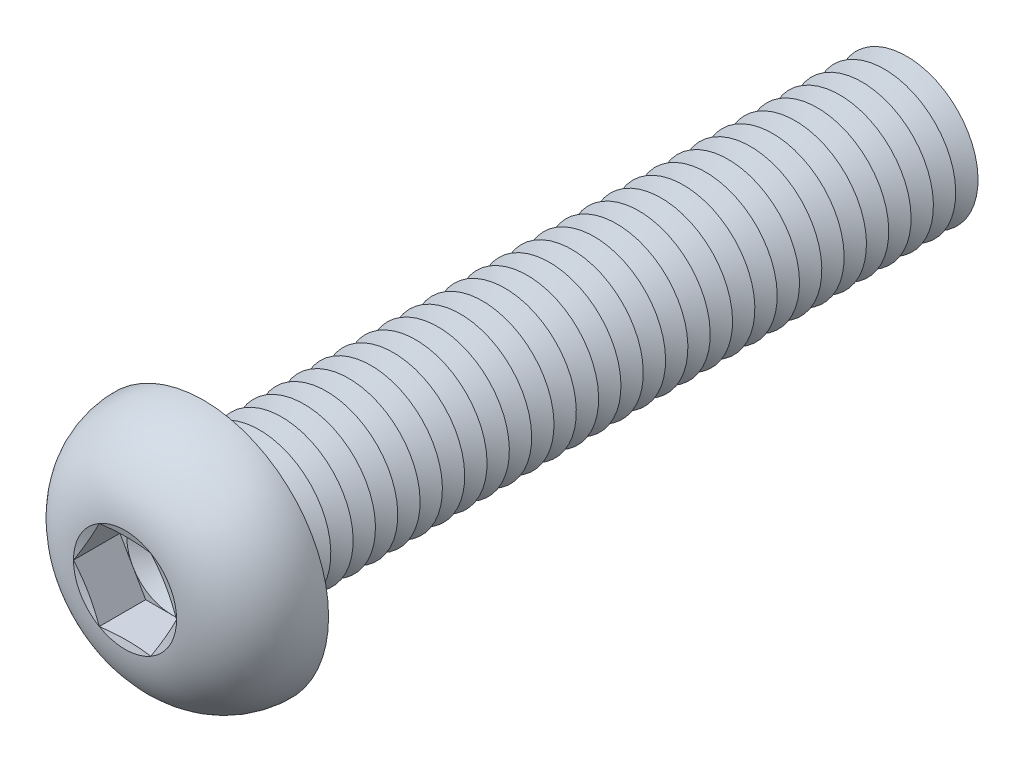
ISO-10303-21;
HEADER;
FILE_DESCRIPTION(('STEP AP214'),'2;1');
FILE_NAME('part.step','',(''),(''),'','','');
FILE_SCHEMA(('AUTOMOTIVE_DESIGN { 1 0 10303 214 1 1 1 1 }'));
ENDSEC;
DATA;
#1=APPLICATION_CONTEXT('core data for automotive mechanical design processes');
#2=APPLICATION_PROTOCOL_DEFINITION('international standard','automotive_design',2000,#1);
#3=PRODUCT_CONTEXT('',#1,'mechanical');
#4=PRODUCT('Part','Part','',(#3));
#5=PRODUCT_RELATED_PRODUCT_CATEGORY('part','',(#4));
#6=PRODUCT_DEFINITION_FORMATION('','',#4);
#7=PRODUCT_DEFINITION_CONTEXT('part definition',#1,'design');
#8=PRODUCT_DEFINITION('design','',#6,#7);
#9=PRODUCT_DEFINITION_SHAPE('','',#8);
#10=(LENGTH_UNIT() NAMED_UNIT(*) SI_UNIT(.MILLI.,.METRE.));
#11=(NAMED_UNIT(*) PLANE_ANGLE_UNIT() SI_UNIT($,.RADIAN.));
#12=(NAMED_UNIT(*) SI_UNIT($,.STERADIAN.) SOLID_ANGLE_UNIT());
#13=UNCERTAINTY_MEASURE_WITH_UNIT(LENGTH_MEASURE(1.E-05),#10,'distance_accuracy_value','');
#14=(GEOMETRIC_REPRESENTATION_CONTEXT(3) GLOBAL_UNCERTAINTY_ASSIGNED_CONTEXT((#13)) GLOBAL_UNIT_ASSIGNED_CONTEXT((#10,
#11,#12)) REPRESENTATION_CONTEXT('',''));
#15=CARTESIAN_POINT('',(0.,0.,0.));
#16=DIRECTION('',(0.,0.,1.));
#17=DIRECTION('',(1.,0.,0.));
#18=AXIS2_PLACEMENT_3D('',#15,#16,#17);
#19=CARTESIAN_POINT('',(0.,0.,1.8));
#20=DIRECTION('',(0.,0.,1.));
#21=DIRECTION('',(1.,0.,0.));
#22=AXIS2_PLACEMENT_3D('',#19,#20,#21);
#23=PLANE('',#22);
#24=CARTESIAN_POINT('',(0.,0.,1.8));
#25=DIRECTION('',(0.,0.,1.));
#26=DIRECTION('',(1.,0.,0.));
#27=AXIS2_PLACEMENT_3D('',#24,#25,#26);
#28=CIRCLE('',#27,2.49999883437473);
#29=CARTESIAN_POINT('',(2.1650625,1.24999941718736,1.8));
#30=VERTEX_POINT('',#29);
#31=CARTESIAN_POINT('',(0.,2.49999883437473,1.8));
#32=VERTEX_POINT('',#31);
#33=EDGE_CURVE('E118',#30,#32,#28,.T.);
#34=ORIENTED_EDGE('',*,*,#33,.F.);
#35=DIRECTION('',(-0.5,0.866025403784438,0.));
#36=VECTOR('',#35,1.);
#37=CARTESIAN_POINT('',(2.88675,0.,1.8));
#38=LINE('',#37,#36);
#39=CARTESIAN_POINT('',(1.443375,2.49999883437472,1.8));
#40=VERTEX_POINT('',#39);
#41=EDGE_CURVE('E125',#30,#40,#38,.T.);
#42=ORIENTED_EDGE('',*,*,#41,.T.);
#43=DIRECTION('',(-1.,0.,0.));
#44=VECTOR('',#43,1.);
#45=CARTESIAN_POINT('',(1.443375,2.49999883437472,1.8));
#46=LINE('',#45,#44);
#47=EDGE_CURVE('E136',#40,#32,#46,.T.);
#48=ORIENTED_EDGE('',*,*,#47,.T.);
#49=EDGE_LOOP('',(#34,#42,#48));
#50=FACE_BOUND('',#49,.T.);
#51=ADVANCED_FACE('F39',(#50),#23,.T.);
#52=CARTESIAN_POINT('',(0.,0.,1.8));
#53=DIRECTION('',(0.,0.,1.));
#54=DIRECTION('',(1.,0.,0.));
#55=AXIS2_PLACEMENT_3D('',#52,#53,#54);
#56=CIRCLE('',#55,2.49999883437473);
#57=CARTESIAN_POINT('',(-2.1650625,1.24999941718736,1.8));
#58=VERTEX_POINT('',#57);
#59=EDGE_CURVE('E11',#32,#58,#56,.T.);
#60=ORIENTED_EDGE('',*,*,#59,.F.);
#61=CARTESIAN_POINT('',(-1.443375,2.49999883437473,1.8));
#62=VERTEX_POINT('',#61);
#63=EDGE_CURVE('E131',#32,#62,#46,.T.);
#64=ORIENTED_EDGE('',*,*,#63,.T.);
#65=DIRECTION('',(-0.5,-0.866025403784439,0.));
#66=VECTOR('',#65,1.);
#67=CARTESIAN_POINT('',(-1.443375,2.49999883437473,1.8));
#68=LINE('',#67,#66);
#69=EDGE_CURVE('E134',#62,#58,#68,.T.);
#70=ORIENTED_EDGE('',*,*,#69,.T.);
#71=EDGE_LOOP('',(#60,#64,#70));
#72=FACE_BOUND('',#71,.T.);
#73=ADVANCED_FACE('F130',(#72),#23,.T.);
#74=CARTESIAN_POINT('',(-2.1650625,-1.24999941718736,1.8));
#75=VERTEX_POINT('',#74);
#76=EDGE_CURVE('E49',#58,#75,#56,.T.);
#77=ORIENTED_EDGE('',*,*,#76,.F.);
#78=CARTESIAN_POINT('',(-2.88675,0.,1.8));
#79=VERTEX_POINT('',#78);
#80=EDGE_CURVE('E143',#58,#79,#68,.T.);
#81=ORIENTED_EDGE('',*,*,#80,.T.);
#82=DIRECTION('',(0.5,-0.866025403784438,0.));
#83=VECTOR('',#82,1.);
#84=CARTESIAN_POINT('',(-2.88675,0.,1.8));
#85=LINE('',#84,#83);
#86=EDGE_CURVE('E151',#79,#75,#85,.T.);
#87=ORIENTED_EDGE('',*,*,#86,.T.);
#88=EDGE_LOOP('',(#77,#81,#87));
#89=FACE_BOUND('',#88,.T.);
#90=ADVANCED_FACE('F524',(#89),#23,.T.);
#91=CARTESIAN_POINT('',(0.,-2.49999883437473,1.8));
#92=VERTEX_POINT('',#91);
#93=EDGE_CURVE('E508',#75,#92,#56,.T.);
#94=ORIENTED_EDGE('',*,*,#93,.F.);
#95=CARTESIAN_POINT('',(-1.443375,-2.49999883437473,1.8));
#96=VERTEX_POINT('',#95);
#97=EDGE_CURVE('E150',#75,#96,#85,.T.);
#98=ORIENTED_EDGE('',*,*,#97,.T.);
#99=DIRECTION('',(1.,0.,0.));
#100=VECTOR('',#99,1.);
#101=CARTESIAN_POINT('',(-1.443375,-2.49999883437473,1.8));
#102=LINE('',#101,#100);
#103=EDGE_CURVE('E156',#96,#92,#102,.T.);
#104=ORIENTED_EDGE('',*,*,#103,.T.);
#105=EDGE_LOOP('',(#94,#98,#104));
#106=FACE_BOUND('',#105,.T.);
#107=ADVANCED_FACE('F517',(#106),#23,.T.);
#108=CARTESIAN_POINT('',(2.1650625,-1.24999941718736,1.8));
#109=VERTEX_POINT('',#108);
#110=EDGE_CURVE('E56',#92,#109,#56,.T.);
#111=ORIENTED_EDGE('',*,*,#110,.F.);
#112=CARTESIAN_POINT('',(1.443375,-2.49999883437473,1.8));
#113=VERTEX_POINT('',#112);
#114=EDGE_CURVE('E155',#92,#113,#102,.T.);
#115=ORIENTED_EDGE('',*,*,#114,.T.);
#116=DIRECTION('',(0.5,0.866025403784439,0.));
#117=VECTOR('',#116,1.);
#118=CARTESIAN_POINT('',(1.443375,-2.49999883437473,1.8));
#119=LINE('',#118,#117);
#120=EDGE_CURVE('E161',#113,#109,#119,.T.);
#121=ORIENTED_EDGE('',*,*,#120,.T.);
#122=EDGE_LOOP('',(#111,#115,#121));
#123=FACE_BOUND('',#122,.T.);
#124=ADVANCED_FACE('F593',(#123),#23,.T.);
#125=CARTESIAN_POINT('',(0.,0.,4.4));
#126=DIRECTION('',(0.,0.,1.));
#127=DIRECTION('',(0.,-1.,0.));
#128=AXIS2_PLACEMENT_3D('',#125,#126,#127);
#129=CONICAL_SURFACE('',#128,2.88675,1.30899693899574);
#130=CARTESIAN_POINT('',(2.88686547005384,-0.000200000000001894,4.40003094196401));
#131=CARTESIAN_POINT('',(2.82691617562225,0.103635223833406,4.3839595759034));
#132=CARTESIAN_POINT('',(2.76685817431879,0.20765873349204,4.36936933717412));
#133=CARTESIAN_POINT('',(2.64653003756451,0.416073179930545,4.3437355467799));
#134=CARTESIAN_POINT('',(2.58625982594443,0.520464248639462,4.33269343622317));
#135=CARTESIAN_POINT('',(2.46587274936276,0.72898078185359,4.31480063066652));
#136=CARTESIAN_POINT('',(2.40575669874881,0.833104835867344,4.3079285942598));
#137=CARTESIAN_POINT('',(2.28544792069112,1.04148575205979,4.29871388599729));
#138=CARTESIAN_POINT('',(2.22525521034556,1.14574258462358,4.29637033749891));
#139=CARTESIAN_POINT('',(2.10486978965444,1.35425624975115,4.29637033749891));
#140=CARTESIAN_POINT('',(2.04467707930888,1.45851308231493,4.29871388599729));
#141=CARTESIAN_POINT('',(1.92436830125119,1.66689399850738,4.3079285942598));
#142=CARTESIAN_POINT('',(1.86425225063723,1.77101805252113,4.31480063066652));
#143=CARTESIAN_POINT('',(1.74386517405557,1.97953458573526,4.33269343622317));
#144=CARTESIAN_POINT('',(1.68359496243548,2.08392565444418,4.3437355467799));
#145=CARTESIAN_POINT('',(1.56326682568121,2.29234010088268,4.36936933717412));
#146=CARTESIAN_POINT('',(1.50320882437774,2.39636361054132,4.3839595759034));
#147=CARTESIAN_POINT('',(1.44325952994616,2.50019883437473,4.40003094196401));
#148=B_SPLINE_CURVE_WITH_KNOTS('',3,(#130,#131,#132,#133,#134,#135,#136,#137,#138,#139,#140,
#141,#142,#143,#144,#145,#146,#147),.UNSPECIFIED.,.F.,.F.,(4,2,2,2,2,2,2,2,4),(0.,
0.362931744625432,0.726010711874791,1.08721550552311,1.44835036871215,1.80948523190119,
2.17069002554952,2.53376899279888,2.89670073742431),.UNSPECIFIED.);
#149=CARTESIAN_POINT('',(2.88675,0.,4.4));
#150=VERTEX_POINT('',#149);
#151=CARTESIAN_POINT('',(1.443375,2.49999883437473,4.4));
#152=VERTEX_POINT('',#151);
#153=EDGE_CURVE('E220',#150,#152,#148,.T.);
#154=ORIENTED_EDGE('',*,*,#153,.F.);
#155=CARTESIAN_POINT('',(0.,0.,4.4));
#156=DIRECTION('',(0.,0.,-1.));
#157=DIRECTION('',(0.,1.,0.));
#158=AXIS2_PLACEMENT_3D('',#155,#156,#157);
#159=CIRCLE('',#158,2.88675);
#160=EDGE_CURVE('E491',#152,#150,#159,.T.);
#161=ORIENTED_EDGE('',*,*,#160,.F.);
#162=EDGE_LOOP('',(#154,#161));
#163=FACE_BOUND('',#162,.T.);
#164=ADVANCED_FACE('F597',(#163),#129,.F.);
#165=CARTESIAN_POINT('',(1.44325952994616,-2.50019883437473,4.40003094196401));
#166=CARTESIAN_POINT('',(1.50320882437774,-2.39636361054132,4.3839595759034));
#167=CARTESIAN_POINT('',(1.56326682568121,-2.29234010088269,4.36936933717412));
#168=CARTESIAN_POINT('',(1.68359496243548,-2.08392565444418,4.3437355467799));
#169=CARTESIAN_POINT('',(1.74386517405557,-1.97953458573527,4.33269343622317));
#170=CARTESIAN_POINT('',(1.86425225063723,-1.77101805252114,4.31480063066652));
#171=CARTESIAN_POINT('',(1.92436830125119,-1.66689399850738,4.3079285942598));
#172=CARTESIAN_POINT('',(2.04467707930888,-1.45851308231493,4.29871388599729));
#173=CARTESIAN_POINT('',(2.10486978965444,-1.35425624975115,4.29637033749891));
#174=CARTESIAN_POINT('',(2.22525521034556,-1.14574258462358,4.29637033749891));
#175=CARTESIAN_POINT('',(2.28544792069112,-1.0414857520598,4.29871388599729));
#176=CARTESIAN_POINT('',(2.40575669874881,-0.833104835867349,4.3079285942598));
#177=CARTESIAN_POINT('',(2.46587274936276,-0.728980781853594,4.31480063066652));
#178=CARTESIAN_POINT('',(2.58625982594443,-0.520464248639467,4.33269343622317));
#179=CARTESIAN_POINT('',(2.64653003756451,-0.41607317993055,4.3437355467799));
#180=CARTESIAN_POINT('',(2.76685817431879,-0.207658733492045,4.36936933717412));
#181=CARTESIAN_POINT('',(2.82691617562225,-0.103635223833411,4.3839595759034));
#182=CARTESIAN_POINT('',(2.88686547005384,0.000199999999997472,4.40003094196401));
#183=B_SPLINE_CURVE_WITH_KNOTS('',3,(#165,#166,#167,#168,#169,#170,#171,#172,#173,#174,#175,
#176,#177,#178,#179,#180,#181,#182),.UNSPECIFIED.,.F.,.F.,(4,2,2,2,2,2,2,2,4),(0.,
0.362931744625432,0.726010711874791,1.08721550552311,1.44835036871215,1.80948523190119,
2.17069002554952,2.53376899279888,2.89670073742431),.UNSPECIFIED.);
#184=CARTESIAN_POINT('',(1.443375,-2.49999883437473,4.4));
#185=VERTEX_POINT('',#184);
#186=EDGE_CURVE('E229',#185,#150,#183,.T.);
#187=ORIENTED_EDGE('',*,*,#186,.F.);
#188=EDGE_CURVE('E496',#150,#185,#159,.T.);
#189=ORIENTED_EDGE('',*,*,#188,.F.);
#190=EDGE_LOOP('',(#187,#189));
#191=FACE_BOUND('',#190,.T.);
#192=ADVANCED_FACE('F559',(#191),#129,.F.);
#193=CARTESIAN_POINT('',(-4.35611719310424,-2.49999883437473,4.97227902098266));
#194=CARTESIAN_POINT('',(-4.25066509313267,-2.49999883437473,4.94777440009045));
#195=CARTESIAN_POINT('',(-4.14516541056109,-2.49999883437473,4.92347459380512));
#196=CARTESIAN_POINT('',(-3.93405094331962,-2.49999883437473,4.87537247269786));
#197=CARTESIAN_POINT('',(-3.82843615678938,-2.49999883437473,4.85157016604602));
#198=CARTESIAN_POINT('',(-3.5113534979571,-2.49999883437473,4.78103338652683));
#199=CARTESIAN_POINT('',(-3.29968815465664,-2.49999883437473,4.73517861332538));
#200=CARTESIAN_POINT('',(-2.87365524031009,-2.49999883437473,4.64645582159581));
#201=CARTESIAN_POINT('',(-2.65928093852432,-2.49999883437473,4.60361983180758));
#202=CARTESIAN_POINT('',(-2.22952626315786,-2.49999883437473,4.52311285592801));
#203=CARTESIAN_POINT('',(-2.01414580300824,-2.49999883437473,4.48544232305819));
#204=CARTESIAN_POINT('',(-1.58798319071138,-2.49999883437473,4.41876559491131));
#205=CARTESIAN_POINT('',(-1.37723418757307,-2.49999883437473,4.38955265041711));
#206=CARTESIAN_POINT('',(-0.954530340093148,-2.49999883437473,4.34171384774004));
#207=CARTESIAN_POINT('',(-0.742575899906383,-2.49999883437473,4.32308463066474));
#208=CARTESIAN_POINT('',(-0.424544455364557,-2.49999883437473,4.30539140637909));
#209=CARTESIAN_POINT('',(-0.318745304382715,-2.49999883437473,4.30120018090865));
#210=CARTESIAN_POINT('',(-0.107062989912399,-2.49999883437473,4.29638997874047));
#211=CARTESIAN_POINT('',(-0.00117982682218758,-2.49999883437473,4.29577098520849));
#212=CARTESIAN_POINT('',(0.210552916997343,-2.49999883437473,4.29814378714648));
#213=CARTESIAN_POINT('',(0.316402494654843,-2.49999883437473,4.30113585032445));
#214=CARTESIAN_POINT('',(0.527944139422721,-2.49999883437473,4.31057322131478));
#215=CARTESIAN_POINT('',(0.633636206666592,-2.49999883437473,4.31701852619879));
#216=CARTESIAN_POINT('',(0.890304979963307,-2.49999883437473,4.33652018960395));
#217=CARTESIAN_POINT('',(1.0411561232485,-2.49999883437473,4.35122885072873));
#218=CARTESIAN_POINT('',(1.34222474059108,-2.49999883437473,4.38593609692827));
#219=CARTESIAN_POINT('',(1.49244223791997,-2.49999883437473,4.40593448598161));
#220=CARTESIAN_POINT('',(1.79273634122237,-2.49999883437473,4.45011321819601));
#221=CARTESIAN_POINT('',(1.94281100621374,-2.49999883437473,4.47430656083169));
#222=CARTESIAN_POINT('',(2.24242097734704,-2.49999883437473,4.52583552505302));
#223=CARTESIAN_POINT('',(2.39195625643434,-2.49999883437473,4.55317130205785));
#224=CARTESIAN_POINT('',(2.69364402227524,-2.49999883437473,4.61079781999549));
#225=CARTESIAN_POINT('',(2.8457870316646,-2.49999883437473,4.64113779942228));
#226=CARTESIAN_POINT('',(3.14969016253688,-2.49999883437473,4.70367638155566));
#227=CARTESIAN_POINT('',(3.30145027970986,-2.49999883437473,4.73587500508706));
#228=CARTESIAN_POINT('',(3.60383766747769,-2.49999883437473,4.80150275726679));
#229=CARTESIAN_POINT('',(3.75446660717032,-2.49999883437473,4.83492423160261));
#230=CARTESIAN_POINT('',(4.05546753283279,-2.49999883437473,4.90285814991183));
#231=CARTESIAN_POINT('',(4.2058395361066,-2.49999883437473,4.9373705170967));
#232=CARTESIAN_POINT('',(4.35611719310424,-2.49999883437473,4.97227902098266));
#233=B_SPLINE_CURVE_WITH_KNOTS('',3,(#193,#194,#195,#196,#197,#198,#199,#200,#201,#202,#203,
#204,#205,#206,#207,#208,#209,#210,#211,#212,#213,#214,#215,#216,#217,#218,#219,#220,#221,#222,
#223,#224,#225,#226,#227,#228,#229,#230,#231,#232),.UNSPECIFIED.,.F.,.F.,(4,2,2,2,2,2,2,2,2,2,2,
2,2,2,2,2,2,2,2,4),(0.,0.324785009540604,0.6495753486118,1.29928181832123,1.95507889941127,
2.61093348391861,3.24905289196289,3.88696967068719,4.204563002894,4.5221548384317,
4.83977022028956,5.15738533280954,5.61196030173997,6.06651842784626,6.52251118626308,
6.97852650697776,7.44392737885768,7.90933346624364,8.37220553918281,8.83504510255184),.UNSPECIFIED.);
#234=CARTESIAN_POINT('',(-1.443375,-2.49999883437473,4.4));
#235=VERTEX_POINT('',#234);
#236=EDGE_CURVE('E538',#235,#185,#233,.T.);
#237=ORIENTED_EDGE('',*,*,#236,.F.);
#238=EDGE_CURVE('E551',#185,#235,#159,.T.);
#239=ORIENTED_EDGE('',*,*,#238,.F.);
#240=EDGE_LOOP('',(#237,#239));
#241=FACE_BOUND('',#240,.T.);
#242=ADVANCED_FACE('F564',(#241),#129,.F.);
#243=CARTESIAN_POINT('',(-2.88686547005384,0.000199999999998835,4.40003094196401));
#244=CARTESIAN_POINT('',(-2.82691617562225,-0.10363522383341,4.3839595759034));
#245=CARTESIAN_POINT('',(-2.76685817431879,-0.207658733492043,4.36936933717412));
#246=CARTESIAN_POINT('',(-2.64653003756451,-0.416073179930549,4.3437355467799));
#247=CARTESIAN_POINT('',(-2.58625982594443,-0.520464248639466,4.33269343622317));
#248=CARTESIAN_POINT('',(-2.46587274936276,-0.728980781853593,4.31480063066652));
#249=CARTESIAN_POINT('',(-2.40575669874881,-0.833104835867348,4.3079285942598));
#250=CARTESIAN_POINT('',(-2.28544792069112,-1.0414857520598,4.29871388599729));
#251=CARTESIAN_POINT('',(-2.22525521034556,-1.14574258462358,4.29637033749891));
#252=CARTESIAN_POINT('',(-2.10486978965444,-1.35425624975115,4.29637033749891));
#253=CARTESIAN_POINT('',(-2.04467707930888,-1.45851308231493,4.29871388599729));
#254=CARTESIAN_POINT('',(-1.92436830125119,-1.66689399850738,4.3079285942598));
#255=CARTESIAN_POINT('',(-1.86425225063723,-1.77101805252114,4.31480063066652));
#256=CARTESIAN_POINT('',(-1.74386517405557,-1.97953458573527,4.33269343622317));
#257=CARTESIAN_POINT('',(-1.68359496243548,-2.08392565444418,4.3437355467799));
#258=CARTESIAN_POINT('',(-1.56326682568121,-2.29234010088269,4.36936933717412));
#259=CARTESIAN_POINT('',(-1.50320882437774,-2.39636361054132,4.3839595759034));
#260=CARTESIAN_POINT('',(-1.44325952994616,-2.50019883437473,4.40003094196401));
#261=B_SPLINE_CURVE_WITH_KNOTS('',3,(#243,#244,#245,#246,#247,#248,#249,#250,#251,#252,#253,
#254,#255,#256,#257,#258,#259,#260),.UNSPECIFIED.,.F.,.F.,(4,2,2,2,2,2,2,2,4),(0.,
0.362931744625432,0.726010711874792,1.08721550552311,1.44835036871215,1.8094852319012,
2.17069002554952,2.53376899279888,2.89670073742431),.UNSPECIFIED.);
#262=CARTESIAN_POINT('',(-2.88675,0.,4.4));
#263=VERTEX_POINT('',#262);
#264=EDGE_CURVE('E529',#263,#235,#261,.T.);
#265=ORIENTED_EDGE('',*,*,#264,.F.);
#266=EDGE_CURVE('E535',#235,#263,#159,.T.);
#267=ORIENTED_EDGE('',*,*,#266,.F.);
#268=EDGE_LOOP('',(#265,#267));
#269=FACE_BOUND('',#268,.T.);
#270=ADVANCED_FACE('F533',(#269),#129,.F.);
#271=CARTESIAN_POINT('',(-1.44325952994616,2.50019883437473,4.40003094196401));
#272=CARTESIAN_POINT('',(-1.50320882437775,2.39636361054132,4.3839595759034));
#273=CARTESIAN_POINT('',(-1.56326682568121,2.29234010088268,4.36936933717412));
#274=CARTESIAN_POINT('',(-1.68359496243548,2.08392565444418,4.3437355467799));
#275=CARTESIAN_POINT('',(-1.74386517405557,1.97953458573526,4.33269343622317));
#276=CARTESIAN_POINT('',(-1.86425225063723,1.77101805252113,4.31480063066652));
#277=CARTESIAN_POINT('',(-1.92436830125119,1.66689399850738,4.3079285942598));
#278=CARTESIAN_POINT('',(-2.04467707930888,1.45851308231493,4.29871388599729));
#279=CARTESIAN_POINT('',(-2.10486978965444,1.35425624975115,4.29637033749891));
#280=CARTESIAN_POINT('',(-2.22525521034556,1.14574258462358,4.29637033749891));
#281=CARTESIAN_POINT('',(-2.28544792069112,1.04148575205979,4.29871388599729));
#282=CARTESIAN_POINT('',(-2.40575669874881,0.833104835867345,4.3079285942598));
#283=CARTESIAN_POINT('',(-2.46587274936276,0.728980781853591,4.31480063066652));
#284=CARTESIAN_POINT('',(-2.58625982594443,0.520464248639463,4.33269343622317));
#285=CARTESIAN_POINT('',(-2.64653003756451,0.416073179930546,4.3437355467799));
#286=CARTESIAN_POINT('',(-2.76685817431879,0.207658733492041,4.36936933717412));
#287=CARTESIAN_POINT('',(-2.82691617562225,0.103635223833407,4.3839595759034));
#288=CARTESIAN_POINT('',(-2.88686547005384,-0.000200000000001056,4.40003094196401));
#289=B_SPLINE_CURVE_WITH_KNOTS('',3,(#271,#272,#273,#274,#275,#276,#277,#278,#279,#280,#281,
#282,#283,#284,#285,#286,#287,#288),.UNSPECIFIED.,.F.,.F.,(4,2,2,2,2,2,2,2,4),(0.,
0.362931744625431,0.72601071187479,1.08721550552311,1.44835036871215,1.80948523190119,
2.17069002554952,2.53376899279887,2.89670073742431),.UNSPECIFIED.);
#290=CARTESIAN_POINT('',(-1.443375,2.49999883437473,4.4));
#291=VERTEX_POINT('',#290);
#292=EDGE_CURVE('E194',#291,#263,#289,.T.);
#293=ORIENTED_EDGE('',*,*,#292,.F.);
#294=EDGE_CURVE('E541',#263,#291,#159,.T.);
#295=ORIENTED_EDGE('',*,*,#294,.F.);
#296=EDGE_LOOP('',(#293,#295));
#297=FACE_BOUND('',#296,.T.);
#298=ADVANCED_FACE('F542',(#297),#129,.F.);
#299=CARTESIAN_POINT('',(0.,0.,-35.625));
#300=DIRECTION('',(0.,0.,1.));
#301=DIRECTION('',(0.,-1.,0.));
#302=AXIS2_PLACEMENT_3D('',#299,#300,#301);
#303=CONICAL_SURFACE('',#302,3.99999999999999,1.0471975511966);
#304=CARTESIAN_POINT('',(0.,0.,-36.25));
#305=DIRECTION('',(0.,0.,1.));
#306=DIRECTION('',(0.,-1.,0.));
#307=AXIS2_PLACEMENT_3D('',#304,#305,#306);
#308=CIRCLE('',#307,2.91746824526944);
#309=CARTESIAN_POINT('',(0.,-2.91746824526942,-36.25));
#310=VERTEX_POINT('',#309);
#311=EDGE_CURVE('E462',#310,#310,#308,.T.);
#312=ORIENTED_EDGE('',*,*,#311,.T.);
#313=EDGE_LOOP('',(#312));
#314=FACE_BOUND('',#313,.T.);
#315=CARTESIAN_POINT('',(0.,0.,-35.625));
#316=DIRECTION('',(0.,0.,1.));
#317=DIRECTION('',(0.,-1.,0.));
#318=AXIS2_PLACEMENT_3D('',#315,#316,#317);
#319=CIRCLE('',#318,3.99999999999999);
#320=CARTESIAN_POINT('',(0.,-3.99999999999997,-35.625));
#321=VERTEX_POINT('',#320);
#322=EDGE_CURVE('E459',#321,#321,#319,.T.);
#323=ORIENTED_EDGE('',*,*,#322,.F.);
#324=EDGE_LOOP('',(#323));
#325=FACE_BOUND('',#324,.T.);
#326=ADVANCED_FACE('F624',(#314,#325),#303,.T.);
#327=CARTESIAN_POINT('',(0.,0.,-36.25));
#328=DIRECTION('',(0.,0.,-1.));
#329=DIRECTION('',(0.,1.,0.));
#330=AXIS2_PLACEMENT_3D('',#327,#328,#329);
#331=CONICAL_SURFACE('',#330,2.91746824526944,1.0471975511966);
#332=CARTESIAN_POINT('',(0.,0.,-36.875));
#333=DIRECTION('',(0.,0.,1.));
#334=DIRECTION('',(0.,-1.,0.));
#335=AXIS2_PLACEMENT_3D('',#332,#333,#334);
#336=CIRCLE('',#335,3.99999999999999);
#337=CARTESIAN_POINT('',(0.,-3.99999999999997,-36.875));
#338=VERTEX_POINT('',#337);
#339=EDGE_CURVE('E466',#338,#338,#336,.T.);
#340=ORIENTED_EDGE('',*,*,#339,.T.);
#341=EDGE_LOOP('',(#340));
#342=FACE_BOUND('',#341,.T.);
#343=ORIENTED_EDGE('',*,*,#311,.F.);
#344=EDGE_LOOP('',(#343));
#345=FACE_BOUND('',#344,.T.);
#346=ADVANCED_FACE('F629',(#342,#345),#331,.T.);
#347=CARTESIAN_POINT('',(0.,4.,-40.));
#348=DIRECTION('',(0.,0.,-1.));
#349=DIRECTION('',(0.,1.,0.));
#350=AXIS2_PLACEMENT_3D('',#347,#348,#349);
#351=PLANE('',#350);
#352=CARTESIAN_POINT('',(0.,0.,-40.));
#353=DIRECTION('',(0.,0.,1.));
#354=DIRECTION('',(0.,-1.,0.));
#355=AXIS2_PLACEMENT_3D('',#352,#353,#354);
#356=CIRCLE('',#355,2.91746824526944);
#357=CARTESIAN_POINT('',(0.,-2.91746824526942,-40.));
#358=VERTEX_POINT('',#357);
#359=EDGE_CURVE('E486',#358,#358,#356,.T.);
#360=ORIENTED_EDGE('',*,*,#359,.F.);
#361=EDGE_LOOP('',(#360));
#362=FACE_BOUND('',#361,.T.);
#363=ADVANCED_FACE('F796',(#362),#351,.T.);
#364=CARTESIAN_POINT('',(0.,0.,-39.375));
#365=DIRECTION('',(0.,0.,1.));
#366=DIRECTION('',(0.,-1.,0.));
#367=AXIS2_PLACEMENT_3D('',#364,#365,#366);
#368=CONICAL_SURFACE('',#367,3.99999999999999,1.0471975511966);
#369=ORIENTED_EDGE('',*,*,#359,.T.);
#370=EDGE_LOOP('',(#369));
#371=FACE_BOUND('',#370,.T.);
#372=CARTESIAN_POINT('',(0.,0.,-39.375));
#373=DIRECTION('',(0.,0.,1.));
#374=DIRECTION('',(0.,-1.,0.));
#375=AXIS2_PLACEMENT_3D('',#372,#373,#374);
#376=CIRCLE('',#375,3.99999999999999);
#377=CARTESIAN_POINT('',(0.,-3.99999999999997,-39.375));
#378=VERTEX_POINT('',#377);
#379=EDGE_CURVE('E482',#378,#378,#376,.T.);
#380=ORIENTED_EDGE('',*,*,#379,.F.);
#381=EDGE_LOOP('',(#380));
#382=FACE_BOUND('',#381,.T.);
#383=ADVANCED_FACE('F789',(#371,#382),#368,.T.);
#384=CARTESIAN_POINT('',(0.,0.,-38.75));
#385=DIRECTION('',(0.,0.,-1.));
#386=DIRECTION('',(0.,1.,0.));
#387=AXIS2_PLACEMENT_3D('',#384,#385,#386);
#388=CONICAL_SURFACE('',#387,2.91746824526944,1.0471975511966);
#389=ORIENTED_EDGE('',*,*,#379,.T.);
#390=EDGE_LOOP('',(#389));
#391=FACE_BOUND('',#390,.T.);
#392=CARTESIAN_POINT('',(0.,0.,-38.75));
#393=DIRECTION('',(0.,0.,1.));
#394=DIRECTION('',(0.,-1.,0.));
#395=AXIS2_PLACEMENT_3D('',#392,#393,#394);
#396=CIRCLE('',#395,2.91746824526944);
#397=CARTESIAN_POINT('',(0.,-2.91746824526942,-38.75));
#398=VERTEX_POINT('',#397);
#399=EDGE_CURVE('E478',#398,#398,#396,.T.);
#400=ORIENTED_EDGE('',*,*,#399,.F.);
#401=EDGE_LOOP('',(#400));
#402=FACE_BOUND('',#401,.T.);
#403=ADVANCED_FACE('F795',(#391,#402),#388,.T.);
#404=CARTESIAN_POINT('',(0.,0.,-38.125));
#405=DIRECTION('',(0.,0.,1.));
#406=DIRECTION('',(0.,-1.,0.));
#407=AXIS2_PLACEMENT_3D('',#404,#405,#406);
#408=CONICAL_SURFACE('',#407,3.99999999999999,1.0471975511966);
#409=ORIENTED_EDGE('',*,*,#399,.T.);
#410=EDGE_LOOP('',(#409));
#411=FACE_BOUND('',#410,.T.);
#412=CARTESIAN_POINT('',(0.,0.,-38.125));
#413=DIRECTION('',(0.,0.,1.));
#414=DIRECTION('',(0.,-1.,0.));
#415=AXIS2_PLACEMENT_3D('',#412,#413,#414);
#416=CIRCLE('',#415,3.99999999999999);
#417=CARTESIAN_POINT('',(0.,-3.99999999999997,-38.125));
#418=VERTEX_POINT('',#417);
#419=EDGE_CURVE('E474',#418,#418,#416,.T.);
#420=ORIENTED_EDGE('',*,*,#419,.F.);
#421=EDGE_LOOP('',(#420));
#422=FACE_BOUND('',#421,.T.);
#423=ADVANCED_FACE('F827',(#411,#422),#408,.T.);
#424=CARTESIAN_POINT('',(0.,0.,-37.5));
#425=DIRECTION('',(0.,0.,-1.));
#426=DIRECTION('',(0.,1.,0.));
#427=AXIS2_PLACEMENT_3D('',#424,#425,#426);
#428=CONICAL_SURFACE('',#427,2.91746824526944,1.0471975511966);
#429=ORIENTED_EDGE('',*,*,#419,.T.);
#430=EDGE_LOOP('',(#429));
#431=FACE_BOUND('',#430,.T.);
#432=CARTESIAN_POINT('',(0.,0.,-37.5));
#433=DIRECTION('',(0.,0.,1.));
#434=DIRECTION('',(0.,-1.,0.));
#435=AXIS2_PLACEMENT_3D('',#432,#433,#434);
#436=CIRCLE('',#435,2.91746824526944);
#437=CARTESIAN_POINT('',(0.,-2.91746824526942,-37.5));
#438=VERTEX_POINT('',#437);
#439=EDGE_CURVE('E470',#438,#438,#436,.T.);
#440=ORIENTED_EDGE('',*,*,#439,.F.);
#441=EDGE_LOOP('',(#440));
#442=FACE_BOUND('',#441,.T.);
#443=ADVANCED_FACE('F837',(#431,#442),#428,.T.);
#444=CARTESIAN_POINT('',(0.,0.,-36.875));
#445=DIRECTION('',(0.,0.,1.));
#446=DIRECTION('',(0.,-1.,0.));
#447=AXIS2_PLACEMENT_3D('',#444,#445,#446);
#448=CONICAL_SURFACE('',#447,3.99999999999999,1.0471975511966);
#449=ORIENTED_EDGE('',*,*,#439,.T.);
#450=EDGE_LOOP('',(#449));
#451=FACE_BOUND('',#450,.T.);
#452=ORIENTED_EDGE('',*,*,#339,.F.);
#453=EDGE_LOOP('',(#452));
#454=FACE_BOUND('',#453,.T.);
#455=ADVANCED_FACE('F847',(#451,#454),#448,.T.);
#456=CARTESIAN_POINT('',(0.,0.,-34.375));
#457=DIRECTION('',(0.,0.,1.));
#458=DIRECTION('',(0.,-1.,0.));
#459=AXIS2_PLACEMENT_3D('',#456,#457,#458);
#460=CONICAL_SURFACE('',#459,3.99999999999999,1.0471975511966);
#461=CARTESIAN_POINT('',(0.,0.,-35.));
#462=DIRECTION('',(0.,0.,1.));
#463=DIRECTION('',(0.,-1.,0.));
#464=AXIS2_PLACEMENT_3D('',#461,#462,#463);
#465=CIRCLE('',#464,2.91746824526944);
#466=CARTESIAN_POINT('',(0.,-2.91746824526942,-35.));
#467=VERTEX_POINT('',#466);
#468=EDGE_CURVE('E455',#467,#467,#465,.T.);
#469=ORIENTED_EDGE('',*,*,#468,.T.);
#470=EDGE_LOOP('',(#469));
#471=FACE_BOUND('',#470,.T.);
#472=CARTESIAN_POINT('',(0.,0.,-34.375));
#473=DIRECTION('',(0.,0.,1.));
#474=DIRECTION('',(0.,-1.,0.));
#475=AXIS2_PLACEMENT_3D('',#472,#473,#474);
#476=CIRCLE('',#475,3.99999999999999);
#477=CARTESIAN_POINT('',(0.,-3.99999999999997,-34.375));
#478=VERTEX_POINT('',#477);
#479=EDGE_CURVE('E451',#478,#478,#476,.T.);
#480=ORIENTED_EDGE('',*,*,#479,.F.);
#481=EDGE_LOOP('',(#480));
#482=FACE_BOUND('',#481,.T.);
#483=ADVANCED_FACE('F857',(#471,#482),#460,.T.);
#484=CARTESIAN_POINT('',(0.,0.,-35.));
#485=DIRECTION('',(0.,0.,-1.));
#486=DIRECTION('',(0.,1.,0.));
#487=AXIS2_PLACEMENT_3D('',#484,#485,#486);
#488=CONICAL_SURFACE('',#487,2.91746824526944,1.0471975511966);
#489=ORIENTED_EDGE('',*,*,#322,.T.);
#490=EDGE_LOOP('',(#489));
#491=FACE_BOUND('',#490,.T.);
#492=ORIENTED_EDGE('',*,*,#468,.F.);
#493=EDGE_LOOP('',(#492));
#494=FACE_BOUND('',#493,.T.);
#495=ADVANCED_FACE('F867',(#491,#494),#488,.T.);
#496=CARTESIAN_POINT('',(0.,0.,-33.125));
#497=DIRECTION('',(0.,0.,1.));
#498=DIRECTION('',(0.,-1.,0.));
#499=AXIS2_PLACEMENT_3D('',#496,#497,#498);
#500=CONICAL_SURFACE('',#499,3.99999999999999,1.0471975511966);
#501=CARTESIAN_POINT('',(0.,0.,-33.75));
#502=DIRECTION('',(0.,0.,1.));
#503=DIRECTION('',(0.,-1.,0.));
#504=AXIS2_PLACEMENT_3D('',#501,#502,#503);
#505=CIRCLE('',#504,2.91746824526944);
#506=CARTESIAN_POINT('',(0.,-2.91746824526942,-33.75));
#507=VERTEX_POINT('',#506);
#508=EDGE_CURVE('E447',#507,#507,#505,.T.);
#509=ORIENTED_EDGE('',*,*,#508,.T.);
#510=EDGE_LOOP('',(#509));
#511=FACE_BOUND('',#510,.T.);
#512=CARTESIAN_POINT('',(0.,0.,-33.125));
#513=DIRECTION('',(0.,0.,1.));
#514=DIRECTION('',(0.,-1.,0.));
#515=AXIS2_PLACEMENT_3D('',#512,#513,#514);
#516=CIRCLE('',#515,3.99999999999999);
#517=CARTESIAN_POINT('',(0.,-3.99999999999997,-33.125));
#518=VERTEX_POINT('',#517);
#519=EDGE_CURVE('E443',#518,#518,#516,.T.);
#520=ORIENTED_EDGE('',*,*,#519,.F.);
#521=EDGE_LOOP('',(#520));
#522=FACE_BOUND('',#521,.T.);
#523=ADVANCED_FACE('F877',(#511,#522),#500,.T.);
#524=CARTESIAN_POINT('',(0.,0.,-33.75));
#525=DIRECTION('',(0.,0.,-1.));
#526=DIRECTION('',(0.,1.,0.));
#527=AXIS2_PLACEMENT_3D('',#524,#525,#526);
#528=CONICAL_SURFACE('',#527,2.91746824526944,1.0471975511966);
#529=ORIENTED_EDGE('',*,*,#479,.T.);
#530=EDGE_LOOP('',(#529));
#531=FACE_BOUND('',#530,.T.);
#532=ORIENTED_EDGE('',*,*,#508,.F.);
#533=EDGE_LOOP('',(#532));
#534=FACE_BOUND('',#533,.T.);
#535=ADVANCED_FACE('F887',(#531,#534),#528,.T.);
#536=CARTESIAN_POINT('',(0.,0.,-31.875));
#537=DIRECTION('',(0.,0.,1.));
#538=DIRECTION('',(0.,-1.,0.));
#539=AXIS2_PLACEMENT_3D('',#536,#537,#538);
#540=CONICAL_SURFACE('',#539,3.99999999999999,1.0471975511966);
#541=CARTESIAN_POINT('',(0.,0.,-32.5));
#542=DIRECTION('',(0.,0.,1.));
#543=DIRECTION('',(0.,-1.,0.));
#544=AXIS2_PLACEMENT_3D('',#541,#542,#543);
#545=CIRCLE('',#544,2.91746824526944);
#546=CARTESIAN_POINT('',(0.,-2.91746824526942,-32.5));
#547=VERTEX_POINT('',#546);
#548=EDGE_CURVE('E439',#547,#547,#545,.T.);
#549=ORIENTED_EDGE('',*,*,#548,.T.);
#550=EDGE_LOOP('',(#549));
#551=FACE_BOUND('',#550,.T.);
#552=CARTESIAN_POINT('',(0.,0.,-31.875));
#553=DIRECTION('',(0.,0.,1.));
#554=DIRECTION('',(0.,-1.,0.));
#555=AXIS2_PLACEMENT_3D('',#552,#553,#554);
#556=CIRCLE('',#555,3.99999999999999);
#557=CARTESIAN_POINT('',(0.,-3.99999999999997,-31.875));
#558=VERTEX_POINT('',#557);
#559=EDGE_CURVE('E435',#558,#558,#556,.T.);
#560=ORIENTED_EDGE('',*,*,#559,.F.);
#561=EDGE_LOOP('',(#560));
#562=FACE_BOUND('',#561,.T.);
#563=ADVANCED_FACE('F897',(#551,#562),#540,.T.);
#564=CARTESIAN_POINT('',(0.,0.,-32.5));
#565=DIRECTION('',(0.,0.,-1.));
#566=DIRECTION('',(0.,1.,0.));
#567=AXIS2_PLACEMENT_3D('',#564,#565,#566);
#568=CONICAL_SURFACE('',#567,2.91746824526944,1.0471975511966);
#569=ORIENTED_EDGE('',*,*,#519,.T.);
#570=EDGE_LOOP('',(#569));
#571=FACE_BOUND('',#570,.T.);
#572=ORIENTED_EDGE('',*,*,#548,.F.);
#573=EDGE_LOOP('',(#572));
#574=FACE_BOUND('',#573,.T.);
#575=ADVANCED_FACE('F907',(#571,#574),#568,.T.);
#576=CARTESIAN_POINT('',(0.,0.,-30.625));
#577=DIRECTION('',(0.,0.,1.));
#578=DIRECTION('',(0.,-1.,0.));
#579=AXIS2_PLACEMENT_3D('',#576,#577,#578);
#580=CONICAL_SURFACE('',#579,3.99999999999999,1.0471975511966);
#581=CARTESIAN_POINT('',(0.,0.,-31.25));
#582=DIRECTION('',(0.,0.,1.));
#583=DIRECTION('',(0.,-1.,0.));
#584=AXIS2_PLACEMENT_3D('',#581,#582,#583);
#585=CIRCLE('',#584,2.91746824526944);
#586=CARTESIAN_POINT('',(0.,-2.91746824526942,-31.25));
#587=VERTEX_POINT('',#586);
#588=EDGE_CURVE('E431',#587,#587,#585,.T.);
#589=ORIENTED_EDGE('',*,*,#588,.T.);
#590=EDGE_LOOP('',(#589));
#591=FACE_BOUND('',#590,.T.);
#592=CARTESIAN_POINT('',(0.,0.,-30.625));
#593=DIRECTION('',(0.,0.,1.));
#594=DIRECTION('',(0.,-1.,0.));
#595=AXIS2_PLACEMENT_3D('',#592,#593,#594);
#596=CIRCLE('',#595,3.99999999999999);
#597=CARTESIAN_POINT('',(0.,-3.99999999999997,-30.625));
#598=VERTEX_POINT('',#597);
#599=EDGE_CURVE('E427',#598,#598,#596,.T.);
#600=ORIENTED_EDGE('',*,*,#599,.F.);
#601=EDGE_LOOP('',(#600));
#602=FACE_BOUND('',#601,.T.);
#603=ADVANCED_FACE('F917',(#591,#602),#580,.T.);
#604=CARTESIAN_POINT('',(0.,0.,-31.25));
#605=DIRECTION('',(0.,0.,-1.));
#606=DIRECTION('',(0.,1.,0.));
#607=AXIS2_PLACEMENT_3D('',#604,#605,#606);
#608=CONICAL_SURFACE('',#607,2.91746824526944,1.0471975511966);
#609=ORIENTED_EDGE('',*,*,#559,.T.);
#610=EDGE_LOOP('',(#609));
#611=FACE_BOUND('',#610,.T.);
#612=ORIENTED_EDGE('',*,*,#588,.F.);
#613=EDGE_LOOP('',(#612));
#614=FACE_BOUND('',#613,.T.);
#615=ADVANCED_FACE('F927',(#611,#614),#608,.T.);
#616=CARTESIAN_POINT('',(0.,0.,-29.375));
#617=DIRECTION('',(0.,0.,1.));
#618=DIRECTION('',(0.,-1.,0.));
#619=AXIS2_PLACEMENT_3D('',#616,#617,#618);
#620=CONICAL_SURFACE('',#619,3.99999999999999,1.0471975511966);
#621=CARTESIAN_POINT('',(0.,0.,-30.));
#622=DIRECTION('',(0.,0.,1.));
#623=DIRECTION('',(0.,-1.,0.));
#624=AXIS2_PLACEMENT_3D('',#621,#622,#623);
#625=CIRCLE('',#624,2.91746824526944);
#626=CARTESIAN_POINT('',(0.,-2.91746824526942,-30.));
#627=VERTEX_POINT('',#626);
#628=EDGE_CURVE('E423',#627,#627,#625,.T.);
#629=ORIENTED_EDGE('',*,*,#628,.T.);
#630=EDGE_LOOP('',(#629));
#631=FACE_BOUND('',#630,.T.);
#632=CARTESIAN_POINT('',(0.,0.,-29.375));
#633=DIRECTION('',(0.,0.,1.));
#634=DIRECTION('',(0.,-1.,0.));
#635=AXIS2_PLACEMENT_3D('',#632,#633,#634);
#636=CIRCLE('',#635,3.99999999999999);
#637=CARTESIAN_POINT('',(0.,-3.99999999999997,-29.375));
#638=VERTEX_POINT('',#637);
#639=EDGE_CURVE('E419',#638,#638,#636,.T.);
#640=ORIENTED_EDGE('',*,*,#639,.F.);
#641=EDGE_LOOP('',(#640));
#642=FACE_BOUND('',#641,.T.);
#643=ADVANCED_FACE('F937',(#631,#642),#620,.T.);
#644=CARTESIAN_POINT('',(0.,0.,-30.));
#645=DIRECTION('',(0.,0.,-1.));
#646=DIRECTION('',(0.,1.,0.));
#647=AXIS2_PLACEMENT_3D('',#644,#645,#646);
#648=CONICAL_SURFACE('',#647,2.91746824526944,1.0471975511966);
#649=ORIENTED_EDGE('',*,*,#599,.T.);
#650=EDGE_LOOP('',(#649));
#651=FACE_BOUND('',#650,.T.);
#652=ORIENTED_EDGE('',*,*,#628,.F.);
#653=EDGE_LOOP('',(#652));
#654=FACE_BOUND('',#653,.T.);
#655=ADVANCED_FACE('F947',(#651,#654),#648,.T.);
#656=CARTESIAN_POINT('',(0.,0.,-28.125));
#657=DIRECTION('',(0.,0.,1.));
#658=DIRECTION('',(0.,-1.,0.));
#659=AXIS2_PLACEMENT_3D('',#656,#657,#658);
#660=CONICAL_SURFACE('',#659,3.99999999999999,1.0471975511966);
#661=CARTESIAN_POINT('',(0.,0.,-28.75));
#662=DIRECTION('',(0.,0.,1.));
#663=DIRECTION('',(0.,-1.,0.));
#664=AXIS2_PLACEMENT_3D('',#661,#662,#663);
#665=CIRCLE('',#664,2.91746824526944);
#666=CARTESIAN_POINT('',(0.,-2.91746824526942,-28.75));
#667=VERTEX_POINT('',#666);
#668=EDGE_CURVE('E415',#667,#667,#665,.T.);
#669=ORIENTED_EDGE('',*,*,#668,.T.);
#670=EDGE_LOOP('',(#669));
#671=FACE_BOUND('',#670,.T.);
#672=CARTESIAN_POINT('',(0.,0.,-28.125));
#673=DIRECTION('',(0.,0.,1.));
#674=DIRECTION('',(0.,-1.,0.));
#675=AXIS2_PLACEMENT_3D('',#672,#673,#674);
#676=CIRCLE('',#675,3.99999999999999);
#677=CARTESIAN_POINT('',(0.,-3.99999999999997,-28.125));
#678=VERTEX_POINT('',#677);
#679=EDGE_CURVE('E411',#678,#678,#676,.T.);
#680=ORIENTED_EDGE('',*,*,#679,.F.);
#681=EDGE_LOOP('',(#680));
#682=FACE_BOUND('',#681,.T.);
#683=ADVANCED_FACE('F957',(#671,#682),#660,.T.);
#684=CARTESIAN_POINT('',(0.,0.,-28.75));
#685=DIRECTION('',(0.,0.,-1.));
#686=DIRECTION('',(0.,1.,0.));
#687=AXIS2_PLACEMENT_3D('',#684,#685,#686);
#688=CONICAL_SURFACE('',#687,2.91746824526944,1.0471975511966);
#689=ORIENTED_EDGE('',*,*,#639,.T.);
#690=EDGE_LOOP('',(#689));
#691=FACE_BOUND('',#690,.T.);
#692=ORIENTED_EDGE('',*,*,#668,.F.);
#693=EDGE_LOOP('',(#692));
#694=FACE_BOUND('',#693,.T.);
#695=ADVANCED_FACE('F967',(#691,#694),#688,.T.);
#696=CARTESIAN_POINT('',(0.,0.,-26.875));
#697=DIRECTION('',(0.,0.,1.));
#698=DIRECTION('',(0.,-1.,0.));
#699=AXIS2_PLACEMENT_3D('',#696,#697,#698);
#700=CONICAL_SURFACE('',#699,3.99999999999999,1.0471975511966);
#701=CARTESIAN_POINT('',(0.,0.,-27.5));
#702=DIRECTION('',(0.,0.,1.));
#703=DIRECTION('',(0.,-1.,0.));
#704=AXIS2_PLACEMENT_3D('',#701,#702,#703);
#705=CIRCLE('',#704,2.91746824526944);
#706=CARTESIAN_POINT('',(0.,-2.91746824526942,-27.5));
#707=VERTEX_POINT('',#706);
#708=EDGE_CURVE('E407',#707,#707,#705,.T.);
#709=ORIENTED_EDGE('',*,*,#708,.T.);
#710=EDGE_LOOP('',(#709));
#711=FACE_BOUND('',#710,.T.);
#712=CARTESIAN_POINT('',(0.,0.,-26.875));
#713=DIRECTION('',(0.,0.,1.));
#714=DIRECTION('',(0.,-1.,0.));
#715=AXIS2_PLACEMENT_3D('',#712,#713,#714);
#716=CIRCLE('',#715,3.99999999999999);
#717=CARTESIAN_POINT('',(0.,-3.99999999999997,-26.875));
#718=VERTEX_POINT('',#717);
#719=EDGE_CURVE('E403',#718,#718,#716,.T.);
#720=ORIENTED_EDGE('',*,*,#719,.F.);
#721=EDGE_LOOP('',(#720));
#722=FACE_BOUND('',#721,.T.);
#723=ADVANCED_FACE('F977',(#711,#722),#700,.T.);
#724=CARTESIAN_POINT('',(0.,0.,-27.5));
#725=DIRECTION('',(0.,0.,-1.));
#726=DIRECTION('',(0.,1.,0.));
#727=AXIS2_PLACEMENT_3D('',#724,#725,#726);
#728=CONICAL_SURFACE('',#727,2.91746824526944,1.0471975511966);
#729=ORIENTED_EDGE('',*,*,#679,.T.);
#730=EDGE_LOOP('',(#729));
#731=FACE_BOUND('',#730,.T.);
#732=ORIENTED_EDGE('',*,*,#708,.F.);
#733=EDGE_LOOP('',(#732));
#734=FACE_BOUND('',#733,.T.);
#735=ADVANCED_FACE('F987',(#731,#734),#728,.T.);
#736=CARTESIAN_POINT('',(0.,0.,-25.625));
#737=DIRECTION('',(0.,0.,1.));
#738=DIRECTION('',(0.,-1.,0.));
#739=AXIS2_PLACEMENT_3D('',#736,#737,#738);
#740=CONICAL_SURFACE('',#739,3.99999999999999,1.0471975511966);
#741=CARTESIAN_POINT('',(0.,0.,-26.25));
#742=DIRECTION('',(0.,0.,1.));
#743=DIRECTION('',(0.,-1.,0.));
#744=AXIS2_PLACEMENT_3D('',#741,#742,#743);
#745=CIRCLE('',#744,2.91746824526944);
#746=CARTESIAN_POINT('',(0.,-2.91746824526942,-26.25));
#747=VERTEX_POINT('',#746);
#748=EDGE_CURVE('E399',#747,#747,#745,.T.);
#749=ORIENTED_EDGE('',*,*,#748,.T.);
#750=EDGE_LOOP('',(#749));
#751=FACE_BOUND('',#750,.T.);
#752=CARTESIAN_POINT('',(0.,0.,-25.625));
#753=DIRECTION('',(0.,0.,1.));
#754=DIRECTION('',(0.,-1.,0.));
#755=AXIS2_PLACEMENT_3D('',#752,#753,#754);
#756=CIRCLE('',#755,3.99999999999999);
#757=CARTESIAN_POINT('',(0.,-3.99999999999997,-25.625));
#758=VERTEX_POINT('',#757);
#759=EDGE_CURVE('E395',#758,#758,#756,.T.);
#760=ORIENTED_EDGE('',*,*,#759,.F.);
#761=EDGE_LOOP('',(#760));
#762=FACE_BOUND('',#761,.T.);
#763=ADVANCED_FACE('F997',(#751,#762),#740,.T.);
#764=CARTESIAN_POINT('',(0.,0.,-26.25));
#765=DIRECTION('',(0.,0.,-1.));
#766=DIRECTION('',(0.,1.,0.));
#767=AXIS2_PLACEMENT_3D('',#764,#765,#766);
#768=CONICAL_SURFACE('',#767,2.91746824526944,1.0471975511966);
#769=ORIENTED_EDGE('',*,*,#719,.T.);
#770=EDGE_LOOP('',(#769));
#771=FACE_BOUND('',#770,.T.);
#772=ORIENTED_EDGE('',*,*,#748,.F.);
#773=EDGE_LOOP('',(#772));
#774=FACE_BOUND('',#773,.T.);
#775=ADVANCED_FACE('F1007',(#771,#774),#768,.T.);
#776=CARTESIAN_POINT('',(0.,0.,-24.375));
#777=DIRECTION('',(0.,0.,1.));
#778=DIRECTION('',(0.,-1.,0.));
#779=AXIS2_PLACEMENT_3D('',#776,#777,#778);
#780=CONICAL_SURFACE('',#779,3.99999999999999,1.0471975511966);
#781=CARTESIAN_POINT('',(0.,0.,-25.));
#782=DIRECTION('',(0.,0.,1.));
#783=DIRECTION('',(0.,-1.,0.));
#784=AXIS2_PLACEMENT_3D('',#781,#782,#783);
#785=CIRCLE('',#784,2.91746824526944);
#786=CARTESIAN_POINT('',(0.,-2.91746824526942,-25.));
#787=VERTEX_POINT('',#786);
#788=EDGE_CURVE('E391',#787,#787,#785,.T.);
#789=ORIENTED_EDGE('',*,*,#788,.T.);
#790=EDGE_LOOP('',(#789));
#791=FACE_BOUND('',#790,.T.);
#792=CARTESIAN_POINT('',(0.,0.,-24.375));
#793=DIRECTION('',(0.,0.,1.));
#794=DIRECTION('',(0.,-1.,0.));
#795=AXIS2_PLACEMENT_3D('',#792,#793,#794);
#796=CIRCLE('',#795,3.99999999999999);
#797=CARTESIAN_POINT('',(0.,-3.99999999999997,-24.375));
#798=VERTEX_POINT('',#797);
#799=EDGE_CURVE('E387',#798,#798,#796,.T.);
#800=ORIENTED_EDGE('',*,*,#799,.F.);
#801=EDGE_LOOP('',(#800));
#802=FACE_BOUND('',#801,.T.);
#803=ADVANCED_FACE('F1017',(#791,#802),#780,.T.);
#804=CARTESIAN_POINT('',(0.,0.,-25.));
#805=DIRECTION('',(0.,0.,-1.));
#806=DIRECTION('',(0.,1.,0.));
#807=AXIS2_PLACEMENT_3D('',#804,#805,#806);
#808=CONICAL_SURFACE('',#807,2.91746824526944,1.0471975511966);
#809=ORIENTED_EDGE('',*,*,#759,.T.);
#810=EDGE_LOOP('',(#809));
#811=FACE_BOUND('',#810,.T.);
#812=ORIENTED_EDGE('',*,*,#788,.F.);
#813=EDGE_LOOP('',(#812));
#814=FACE_BOUND('',#813,.T.);
#815=ADVANCED_FACE('F1027',(#811,#814),#808,.T.);
#816=CARTESIAN_POINT('',(0.,0.,-23.125));
#817=DIRECTION('',(0.,0.,1.));
#818=DIRECTION('',(0.,-1.,0.));
#819=AXIS2_PLACEMENT_3D('',#816,#817,#818);
#820=CONICAL_SURFACE('',#819,3.99999999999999,1.0471975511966);
#821=CARTESIAN_POINT('',(0.,0.,-23.75));
#822=DIRECTION('',(0.,0.,1.));
#823=DIRECTION('',(0.,-1.,0.));
#824=AXIS2_PLACEMENT_3D('',#821,#822,#823);
#825=CIRCLE('',#824,2.91746824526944);
#826=CARTESIAN_POINT('',(0.,-2.91746824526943,-23.75));
#827=VERTEX_POINT('',#826);
#828=EDGE_CURVE('E383',#827,#827,#825,.T.);
#829=ORIENTED_EDGE('',*,*,#828,.T.);
#830=EDGE_LOOP('',(#829));
#831=FACE_BOUND('',#830,.T.);
#832=CARTESIAN_POINT('',(0.,0.,-23.125));
#833=DIRECTION('',(0.,0.,1.));
#834=DIRECTION('',(0.,-1.,0.));
#835=AXIS2_PLACEMENT_3D('',#832,#833,#834);
#836=CIRCLE('',#835,3.99999999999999);
#837=CARTESIAN_POINT('',(0.,-3.99999999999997,-23.125));
#838=VERTEX_POINT('',#837);
#839=EDGE_CURVE('E379',#838,#838,#836,.T.);
#840=ORIENTED_EDGE('',*,*,#839,.F.);
#841=EDGE_LOOP('',(#840));
#842=FACE_BOUND('',#841,.T.);
#843=ADVANCED_FACE('F1037',(#831,#842),#820,.T.);
#844=CARTESIAN_POINT('',(0.,0.,-23.75));
#845=DIRECTION('',(0.,0.,-1.));
#846=DIRECTION('',(0.,1.,0.));
#847=AXIS2_PLACEMENT_3D('',#844,#845,#846);
#848=CONICAL_SURFACE('',#847,2.91746824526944,1.0471975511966);
#849=ORIENTED_EDGE('',*,*,#799,.T.);
#850=EDGE_LOOP('',(#849));
#851=FACE_BOUND('',#850,.T.);
#852=ORIENTED_EDGE('',*,*,#828,.F.);
#853=EDGE_LOOP('',(#852));
#854=FACE_BOUND('',#853,.T.);
#855=ADVANCED_FACE('F1047',(#851,#854),#848,.T.);
#856=CARTESIAN_POINT('',(0.,0.,-21.875));
#857=DIRECTION('',(0.,0.,1.));
#858=DIRECTION('',(0.,-1.,0.));
#859=AXIS2_PLACEMENT_3D('',#856,#857,#858);
#860=CONICAL_SURFACE('',#859,3.99999999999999,1.0471975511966);
#861=CARTESIAN_POINT('',(0.,0.,-22.5));
#862=DIRECTION('',(0.,0.,1.));
#863=DIRECTION('',(0.,-1.,0.));
#864=AXIS2_PLACEMENT_3D('',#861,#862,#863);
#865=CIRCLE('',#864,2.91746824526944);
#866=CARTESIAN_POINT('',(0.,-2.91746824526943,-22.5));
#867=VERTEX_POINT('',#866);
#868=EDGE_CURVE('E375',#867,#867,#865,.T.);
#869=ORIENTED_EDGE('',*,*,#868,.T.);
#870=EDGE_LOOP('',(#869));
#871=FACE_BOUND('',#870,.T.);
#872=CARTESIAN_POINT('',(0.,0.,-21.875));
#873=DIRECTION('',(0.,0.,1.));
#874=DIRECTION('',(0.,-1.,0.));
#875=AXIS2_PLACEMENT_3D('',#872,#873,#874);
#876=CIRCLE('',#875,3.99999999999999);
#877=CARTESIAN_POINT('',(0.,-3.99999999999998,-21.875));
#878=VERTEX_POINT('',#877);
#879=EDGE_CURVE('E371',#878,#878,#876,.T.);
#880=ORIENTED_EDGE('',*,*,#879,.F.);
#881=EDGE_LOOP('',(#880));
#882=FACE_BOUND('',#881,.T.);
#883=ADVANCED_FACE('F1057',(#871,#882),#860,.T.);
#884=CARTESIAN_POINT('',(0.,0.,-22.5));
#885=DIRECTION('',(0.,0.,-1.));
#886=DIRECTION('',(0.,1.,0.));
#887=AXIS2_PLACEMENT_3D('',#884,#885,#886);
#888=CONICAL_SURFACE('',#887,2.91746824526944,1.0471975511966);
#889=ORIENTED_EDGE('',*,*,#839,.T.);
#890=EDGE_LOOP('',(#889));
#891=FACE_BOUND('',#890,.T.);
#892=ORIENTED_EDGE('',*,*,#868,.F.);
#893=EDGE_LOOP('',(#892));
#894=FACE_BOUND('',#893,.T.);
#895=ADVANCED_FACE('F1067',(#891,#894),#888,.T.);
#896=CARTESIAN_POINT('',(0.,0.,-20.625));
#897=DIRECTION('',(0.,0.,1.));
#898=DIRECTION('',(0.,-1.,0.));
#899=AXIS2_PLACEMENT_3D('',#896,#897,#898);
#900=CONICAL_SURFACE('',#899,3.99999999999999,1.0471975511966);
#901=CARTESIAN_POINT('',(0.,0.,-21.25));
#902=DIRECTION('',(0.,0.,1.));
#903=DIRECTION('',(0.,-1.,0.));
#904=AXIS2_PLACEMENT_3D('',#901,#902,#903);
#905=CIRCLE('',#904,2.91746824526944);
#906=CARTESIAN_POINT('',(0.,-2.91746824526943,-21.25));
#907=VERTEX_POINT('',#906);
#908=EDGE_CURVE('E367',#907,#907,#905,.T.);
#909=ORIENTED_EDGE('',*,*,#908,.T.);
#910=EDGE_LOOP('',(#909));
#911=FACE_BOUND('',#910,.T.);
#912=CARTESIAN_POINT('',(0.,0.,-20.625));
#913=DIRECTION('',(0.,0.,1.));
#914=DIRECTION('',(0.,-1.,0.));
#915=AXIS2_PLACEMENT_3D('',#912,#913,#914);
#916=CIRCLE('',#915,3.99999999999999);
#917=CARTESIAN_POINT('',(0.,-3.99999999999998,-20.625));
#918=VERTEX_POINT('',#917);
#919=EDGE_CURVE('E363',#918,#918,#916,.T.);
#920=ORIENTED_EDGE('',*,*,#919,.F.);
#921=EDGE_LOOP('',(#920));
#922=FACE_BOUND('',#921,.T.);
#923=ADVANCED_FACE('F1077',(#911,#922),#900,.T.);
#924=CARTESIAN_POINT('',(0.,0.,-21.25));
#925=DIRECTION('',(0.,0.,-1.));
#926=DIRECTION('',(0.,1.,0.));
#927=AXIS2_PLACEMENT_3D('',#924,#925,#926);
#928=CONICAL_SURFACE('',#927,2.91746824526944,1.0471975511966);
#929=ORIENTED_EDGE('',*,*,#879,.T.);
#930=EDGE_LOOP('',(#929));
#931=FACE_BOUND('',#930,.T.);
#932=ORIENTED_EDGE('',*,*,#908,.F.);
#933=EDGE_LOOP('',(#932));
#934=FACE_BOUND('',#933,.T.);
#935=ADVANCED_FACE('F1087',(#931,#934),#928,.T.);
#936=CARTESIAN_POINT('',(0.,0.,-19.375));
#937=DIRECTION('',(0.,0.,1.));
#938=DIRECTION('',(0.,-1.,0.));
#939=AXIS2_PLACEMENT_3D('',#936,#937,#938);
#940=CONICAL_SURFACE('',#939,3.99999999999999,1.0471975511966);
#941=CARTESIAN_POINT('',(0.,0.,-20.));
#942=DIRECTION('',(0.,0.,1.));
#943=DIRECTION('',(0.,-1.,0.));
#944=AXIS2_PLACEMENT_3D('',#941,#942,#943);
#945=CIRCLE('',#944,2.91746824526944);
#946=CARTESIAN_POINT('',(0.,-2.91746824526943,-20.));
#947=VERTEX_POINT('',#946);
#948=EDGE_CURVE('E359',#947,#947,#945,.T.);
#949=ORIENTED_EDGE('',*,*,#948,.T.);
#950=EDGE_LOOP('',(#949));
#951=FACE_BOUND('',#950,.T.);
#952=CARTESIAN_POINT('',(0.,0.,-19.375));
#953=DIRECTION('',(0.,0.,1.));
#954=DIRECTION('',(0.,-1.,0.));
#955=AXIS2_PLACEMENT_3D('',#952,#953,#954);
#956=CIRCLE('',#955,3.99999999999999);
#957=CARTESIAN_POINT('',(0.,-3.99999999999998,-19.375));
#958=VERTEX_POINT('',#957);
#959=EDGE_CURVE('E355',#958,#958,#956,.T.);
#960=ORIENTED_EDGE('',*,*,#959,.F.);
#961=EDGE_LOOP('',(#960));
#962=FACE_BOUND('',#961,.T.);
#963=ADVANCED_FACE('F1097',(#951,#962),#940,.T.);
#964=CARTESIAN_POINT('',(0.,0.,-20.));
#965=DIRECTION('',(0.,0.,-1.));
#966=DIRECTION('',(0.,1.,0.));
#967=AXIS2_PLACEMENT_3D('',#964,#965,#966);
#968=CONICAL_SURFACE('',#967,2.91746824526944,1.0471975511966);
#969=ORIENTED_EDGE('',*,*,#919,.T.);
#970=EDGE_LOOP('',(#969));
#971=FACE_BOUND('',#970,.T.);
#972=ORIENTED_EDGE('',*,*,#948,.F.);
#973=EDGE_LOOP('',(#972));
#974=FACE_BOUND('',#973,.T.);
#975=ADVANCED_FACE('F1107',(#971,#974),#968,.T.);
#976=CARTESIAN_POINT('',(0.,0.,-18.125));
#977=DIRECTION('',(0.,0.,1.));
#978=DIRECTION('',(0.,-1.,0.));
#979=AXIS2_PLACEMENT_3D('',#976,#977,#978);
#980=CONICAL_SURFACE('',#979,3.99999999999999,1.0471975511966);
#981=CARTESIAN_POINT('',(0.,0.,-18.75));
#982=DIRECTION('',(0.,0.,1.));
#983=DIRECTION('',(0.,-1.,0.));
#984=AXIS2_PLACEMENT_3D('',#981,#982,#983);
#985=CIRCLE('',#984,2.91746824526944);
#986=CARTESIAN_POINT('',(0.,-2.91746824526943,-18.75));
#987=VERTEX_POINT('',#986);
#988=EDGE_CURVE('E351',#987,#987,#985,.T.);
#989=ORIENTED_EDGE('',*,*,#988,.T.);
#990=EDGE_LOOP('',(#989));
#991=FACE_BOUND('',#990,.T.);
#992=CARTESIAN_POINT('',(0.,0.,-18.125));
#993=DIRECTION('',(0.,0.,1.));
#994=DIRECTION('',(0.,-1.,0.));
#995=AXIS2_PLACEMENT_3D('',#992,#993,#994);
#996=CIRCLE('',#995,3.99999999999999);
#997=CARTESIAN_POINT('',(0.,-3.99999999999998,-18.125));
#998=VERTEX_POINT('',#997);
#999=EDGE_CURVE('E347',#998,#998,#996,.T.);
#1000=ORIENTED_EDGE('',*,*,#999,.F.);
#1001=EDGE_LOOP('',(#1000));
#1002=FACE_BOUND('',#1001,.T.);
#1003=ADVANCED_FACE('F1117',(#991,#1002),#980,.T.);
#1004=CARTESIAN_POINT('',(0.,0.,-18.75));
#1005=DIRECTION('',(0.,0.,-1.));
#1006=DIRECTION('',(0.,1.,0.));
#1007=AXIS2_PLACEMENT_3D('',#1004,#1005,#1006);
#1008=CONICAL_SURFACE('',#1007,2.91746824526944,1.0471975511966);
#1009=ORIENTED_EDGE('',*,*,#959,.T.);
#1010=EDGE_LOOP('',(#1009));
#1011=FACE_BOUND('',#1010,.T.);
#1012=ORIENTED_EDGE('',*,*,#988,.F.);
#1013=EDGE_LOOP('',(#1012));
#1014=FACE_BOUND('',#1013,.T.);
#1015=ADVANCED_FACE('F1127',(#1011,#1014),#1008,.T.);
#1016=CARTESIAN_POINT('',(0.,0.,-16.875));
#1017=DIRECTION('',(0.,0.,1.));
#1018=DIRECTION('',(0.,-1.,0.));
#1019=AXIS2_PLACEMENT_3D('',#1016,#1017,#1018);
#1020=CONICAL_SURFACE('',#1019,3.99999999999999,1.0471975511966);
#1021=CARTESIAN_POINT('',(0.,0.,-17.5));
#1022=DIRECTION('',(0.,0.,1.));
#1023=DIRECTION('',(0.,-1.,0.));
#1024=AXIS2_PLACEMENT_3D('',#1021,#1022,#1023);
#1025=CIRCLE('',#1024,2.91746824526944);
#1026=CARTESIAN_POINT('',(0.,-2.91746824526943,-17.5));
#1027=VERTEX_POINT('',#1026);
#1028=EDGE_CURVE('E343',#1027,#1027,#1025,.T.);
#1029=ORIENTED_EDGE('',*,*,#1028,.T.);
#1030=EDGE_LOOP('',(#1029));
#1031=FACE_BOUND('',#1030,.T.);
#1032=CARTESIAN_POINT('',(0.,0.,-16.875));
#1033=DIRECTION('',(0.,0.,1.));
#1034=DIRECTION('',(0.,-1.,0.));
#1035=AXIS2_PLACEMENT_3D('',#1032,#1033,#1034);
#1036=CIRCLE('',#1035,3.99999999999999);
#1037=CARTESIAN_POINT('',(0.,-3.99999999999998,-16.875));
#1038=VERTEX_POINT('',#1037);
#1039=EDGE_CURVE('E339',#1038,#1038,#1036,.T.);
#1040=ORIENTED_EDGE('',*,*,#1039,.F.);
#1041=EDGE_LOOP('',(#1040));
#1042=FACE_BOUND('',#1041,.T.);
#1043=ADVANCED_FACE('F1137',(#1031,#1042),#1020,.T.);
#1044=CARTESIAN_POINT('',(0.,0.,-17.5));
#1045=DIRECTION('',(0.,0.,-1.));
#1046=DIRECTION('',(0.,1.,0.));
#1047=AXIS2_PLACEMENT_3D('',#1044,#1045,#1046);
#1048=CONICAL_SURFACE('',#1047,2.91746824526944,1.0471975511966);
#1049=ORIENTED_EDGE('',*,*,#999,.T.);
#1050=EDGE_LOOP('',(#1049));
#1051=FACE_BOUND('',#1050,.T.);
#1052=ORIENTED_EDGE('',*,*,#1028,.F.);
#1053=EDGE_LOOP('',(#1052));
#1054=FACE_BOUND('',#1053,.T.);
#1055=ADVANCED_FACE('F1147',(#1051,#1054),#1048,.T.);
#1056=CARTESIAN_POINT('',(0.,0.,-15.625));
#1057=DIRECTION('',(0.,0.,1.));
#1058=DIRECTION('',(0.,-1.,0.));
#1059=AXIS2_PLACEMENT_3D('',#1056,#1057,#1058);
#1060=CONICAL_SURFACE('',#1059,3.99999999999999,1.0471975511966);
#1061=CARTESIAN_POINT('',(0.,0.,-16.25));
#1062=DIRECTION('',(0.,0.,1.));
#1063=DIRECTION('',(0.,-1.,0.));
#1064=AXIS2_PLACEMENT_3D('',#1061,#1062,#1063);
#1065=CIRCLE('',#1064,2.91746824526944);
#1066=CARTESIAN_POINT('',(0.,-2.91746824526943,-16.25));
#1067=VERTEX_POINT('',#1066);
#1068=EDGE_CURVE('E335',#1067,#1067,#1065,.T.);
#1069=ORIENTED_EDGE('',*,*,#1068,.T.);
#1070=EDGE_LOOP('',(#1069));
#1071=FACE_BOUND('',#1070,.T.);
#1072=CARTESIAN_POINT('',(0.,0.,-15.625));
#1073=DIRECTION('',(0.,0.,1.));
#1074=DIRECTION('',(0.,-1.,0.));
#1075=AXIS2_PLACEMENT_3D('',#1072,#1073,#1074);
#1076=CIRCLE('',#1075,3.99999999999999);
#1077=CARTESIAN_POINT('',(0.,-3.99999999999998,-15.625));
#1078=VERTEX_POINT('',#1077);
#1079=EDGE_CURVE('E331',#1078,#1078,#1076,.T.);
#1080=ORIENTED_EDGE('',*,*,#1079,.F.);
#1081=EDGE_LOOP('',(#1080));
#1082=FACE_BOUND('',#1081,.T.);
#1083=ADVANCED_FACE('F1157',(#1071,#1082),#1060,.T.);
#1084=CARTESIAN_POINT('',(0.,0.,-16.25));
#1085=DIRECTION('',(0.,0.,-1.));
#1086=DIRECTION('',(0.,1.,0.));
#1087=AXIS2_PLACEMENT_3D('',#1084,#1085,#1086);
#1088=CONICAL_SURFACE('',#1087,2.91746824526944,1.0471975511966);
#1089=ORIENTED_EDGE('',*,*,#1039,.T.);
#1090=EDGE_LOOP('',(#1089));
#1091=FACE_BOUND('',#1090,.T.);
#1092=ORIENTED_EDGE('',*,*,#1068,.F.);
#1093=EDGE_LOOP('',(#1092));
#1094=FACE_BOUND('',#1093,.T.);
#1095=ADVANCED_FACE('F1167',(#1091,#1094),#1088,.T.);
#1096=CARTESIAN_POINT('',(0.,0.,-14.375));
#1097=DIRECTION('',(0.,0.,1.));
#1098=DIRECTION('',(0.,-1.,0.));
#1099=AXIS2_PLACEMENT_3D('',#1096,#1097,#1098);
#1100=CONICAL_SURFACE('',#1099,3.99999999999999,1.0471975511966);
#1101=CARTESIAN_POINT('',(0.,0.,-15.));
#1102=DIRECTION('',(0.,0.,1.));
#1103=DIRECTION('',(0.,-1.,0.));
#1104=AXIS2_PLACEMENT_3D('',#1101,#1102,#1103);
#1105=CIRCLE('',#1104,2.91746824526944);
#1106=CARTESIAN_POINT('',(0.,-2.91746824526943,-15.));
#1107=VERTEX_POINT('',#1106);
#1108=EDGE_CURVE('E327',#1107,#1107,#1105,.T.);
#1109=ORIENTED_EDGE('',*,*,#1108,.T.);
#1110=EDGE_LOOP('',(#1109));
#1111=FACE_BOUND('',#1110,.T.);
#1112=CARTESIAN_POINT('',(0.,0.,-14.375));
#1113=DIRECTION('',(0.,0.,1.));
#1114=DIRECTION('',(0.,-1.,0.));
#1115=AXIS2_PLACEMENT_3D('',#1112,#1113,#1114);
#1116=CIRCLE('',#1115,3.99999999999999);
#1117=CARTESIAN_POINT('',(0.,-3.99999999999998,-14.375));
#1118=VERTEX_POINT('',#1117);
#1119=EDGE_CURVE('E323',#1118,#1118,#1116,.T.);
#1120=ORIENTED_EDGE('',*,*,#1119,.F.);
#1121=EDGE_LOOP('',(#1120));
#1122=FACE_BOUND('',#1121,.T.);
#1123=ADVANCED_FACE('F1177',(#1111,#1122),#1100,.T.);
#1124=CARTESIAN_POINT('',(0.,0.,-15.));
#1125=DIRECTION('',(0.,0.,-1.));
#1126=DIRECTION('',(0.,1.,0.));
#1127=AXIS2_PLACEMENT_3D('',#1124,#1125,#1126);
#1128=CONICAL_SURFACE('',#1127,2.91746824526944,1.0471975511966);
#1129=ORIENTED_EDGE('',*,*,#1079,.T.);
#1130=EDGE_LOOP('',(#1129));
#1131=FACE_BOUND('',#1130,.T.);
#1132=ORIENTED_EDGE('',*,*,#1108,.F.);
#1133=EDGE_LOOP('',(#1132));
#1134=FACE_BOUND('',#1133,.T.);
#1135=ADVANCED_FACE('F1187',(#1131,#1134),#1128,.T.);
#1136=CARTESIAN_POINT('',(0.,0.,-13.125));
#1137=DIRECTION('',(0.,0.,1.));
#1138=DIRECTION('',(0.,-1.,0.));
#1139=AXIS2_PLACEMENT_3D('',#1136,#1137,#1138);
#1140=CONICAL_SURFACE('',#1139,3.99999999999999,1.0471975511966);
#1141=CARTESIAN_POINT('',(0.,0.,-13.75));
#1142=DIRECTION('',(0.,0.,1.));
#1143=DIRECTION('',(0.,-1.,0.));
#1144=AXIS2_PLACEMENT_3D('',#1141,#1142,#1143);
#1145=CIRCLE('',#1144,2.91746824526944);
#1146=CARTESIAN_POINT('',(0.,-2.91746824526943,-13.75));
#1147=VERTEX_POINT('',#1146);
#1148=EDGE_CURVE('E319',#1147,#1147,#1145,.T.);
#1149=ORIENTED_EDGE('',*,*,#1148,.T.);
#1150=EDGE_LOOP('',(#1149));
#1151=FACE_BOUND('',#1150,.T.);
#1152=CARTESIAN_POINT('',(0.,0.,-13.125));
#1153=DIRECTION('',(0.,0.,1.));
#1154=DIRECTION('',(0.,-1.,0.));
#1155=AXIS2_PLACEMENT_3D('',#1152,#1153,#1154);
#1156=CIRCLE('',#1155,3.99999999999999);
#1157=CARTESIAN_POINT('',(0.,-3.99999999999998,-13.125));
#1158=VERTEX_POINT('',#1157);
#1159=EDGE_CURVE('E315',#1158,#1158,#1156,.T.);
#1160=ORIENTED_EDGE('',*,*,#1159,.F.);
#1161=EDGE_LOOP('',(#1160));
#1162=FACE_BOUND('',#1161,.T.);
#1163=ADVANCED_FACE('F1197',(#1151,#1162),#1140,.T.);
#1164=CARTESIAN_POINT('',(0.,0.,-13.75));
#1165=DIRECTION('',(0.,0.,-1.));
#1166=DIRECTION('',(0.,1.,0.));
#1167=AXIS2_PLACEMENT_3D('',#1164,#1165,#1166);
#1168=CONICAL_SURFACE('',#1167,2.91746824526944,1.0471975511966);
#1169=ORIENTED_EDGE('',*,*,#1119,.T.);
#1170=EDGE_LOOP('',(#1169));
#1171=FACE_BOUND('',#1170,.T.);
#1172=ORIENTED_EDGE('',*,*,#1148,.F.);
#1173=EDGE_LOOP('',(#1172));
#1174=FACE_BOUND('',#1173,.T.);
#1175=ADVANCED_FACE('F1207',(#1171,#1174),#1168,.T.);
#1176=CARTESIAN_POINT('',(0.,0.,-11.875));
#1177=DIRECTION('',(0.,0.,1.));
#1178=DIRECTION('',(0.,-1.,0.));
#1179=AXIS2_PLACEMENT_3D('',#1176,#1177,#1178);
#1180=CONICAL_SURFACE('',#1179,3.99999999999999,1.0471975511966);
#1181=CARTESIAN_POINT('',(0.,0.,-12.5));
#1182=DIRECTION('',(0.,0.,1.));
#1183=DIRECTION('',(0.,-1.,0.));
#1184=AXIS2_PLACEMENT_3D('',#1181,#1182,#1183);
#1185=CIRCLE('',#1184,2.91746824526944);
#1186=CARTESIAN_POINT('',(0.,-2.91746824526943,-12.5));
#1187=VERTEX_POINT('',#1186);
#1188=EDGE_CURVE('E311',#1187,#1187,#1185,.T.);
#1189=ORIENTED_EDGE('',*,*,#1188,.T.);
#1190=EDGE_LOOP('',(#1189));
#1191=FACE_BOUND('',#1190,.T.);
#1192=CARTESIAN_POINT('',(0.,0.,-11.875));
#1193=DIRECTION('',(0.,0.,1.));
#1194=DIRECTION('',(0.,-1.,0.));
#1195=AXIS2_PLACEMENT_3D('',#1192,#1193,#1194);
#1196=CIRCLE('',#1195,3.99999999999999);
#1197=CARTESIAN_POINT('',(0.,-3.99999999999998,-11.875));
#1198=VERTEX_POINT('',#1197);
#1199=EDGE_CURVE('E307',#1198,#1198,#1196,.T.);
#1200=ORIENTED_EDGE('',*,*,#1199,.F.);
#1201=EDGE_LOOP('',(#1200));
#1202=FACE_BOUND('',#1201,.T.);
#1203=ADVANCED_FACE('F1217',(#1191,#1202),#1180,.T.);
#1204=CARTESIAN_POINT('',(0.,0.,-12.5));
#1205=DIRECTION('',(0.,0.,-1.));
#1206=DIRECTION('',(0.,1.,0.));
#1207=AXIS2_PLACEMENT_3D('',#1204,#1205,#1206);
#1208=CONICAL_SURFACE('',#1207,2.91746824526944,1.0471975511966);
#1209=ORIENTED_EDGE('',*,*,#1159,.T.);
#1210=EDGE_LOOP('',(#1209));
#1211=FACE_BOUND('',#1210,.T.);
#1212=ORIENTED_EDGE('',*,*,#1188,.F.);
#1213=EDGE_LOOP('',(#1212));
#1214=FACE_BOUND('',#1213,.T.);
#1215=ADVANCED_FACE('F1227',(#1211,#1214),#1208,.T.);
#1216=CARTESIAN_POINT('',(0.,0.,-10.625));
#1217=DIRECTION('',(0.,0.,1.));
#1218=DIRECTION('',(0.,-1.,0.));
#1219=AXIS2_PLACEMENT_3D('',#1216,#1217,#1218);
#1220=CONICAL_SURFACE('',#1219,3.99999999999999,1.0471975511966);
#1221=CARTESIAN_POINT('',(0.,0.,-11.25));
#1222=DIRECTION('',(0.,0.,1.));
#1223=DIRECTION('',(0.,-1.,0.));
#1224=AXIS2_PLACEMENT_3D('',#1221,#1222,#1223);
#1225=CIRCLE('',#1224,2.91746824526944);
#1226=CARTESIAN_POINT('',(0.,-2.91746824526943,-11.25));
#1227=VERTEX_POINT('',#1226);
#1228=EDGE_CURVE('E303',#1227,#1227,#1225,.T.);
#1229=ORIENTED_EDGE('',*,*,#1228,.T.);
#1230=EDGE_LOOP('',(#1229));
#1231=FACE_BOUND('',#1230,.T.);
#1232=CARTESIAN_POINT('',(0.,0.,-10.625));
#1233=DIRECTION('',(0.,0.,1.));
#1234=DIRECTION('',(0.,-1.,0.));
#1235=AXIS2_PLACEMENT_3D('',#1232,#1233,#1234);
#1236=CIRCLE('',#1235,3.99999999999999);
#1237=CARTESIAN_POINT('',(0.,-3.99999999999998,-10.625));
#1238=VERTEX_POINT('',#1237);
#1239=EDGE_CURVE('E299',#1238,#1238,#1236,.T.);
#1240=ORIENTED_EDGE('',*,*,#1239,.F.);
#1241=EDGE_LOOP('',(#1240));
#1242=FACE_BOUND('',#1241,.T.);
#1243=ADVANCED_FACE('F1237',(#1231,#1242),#1220,.T.);
#1244=CARTESIAN_POINT('',(0.,0.,-11.25));
#1245=DIRECTION('',(0.,0.,-1.));
#1246=DIRECTION('',(0.,1.,0.));
#1247=AXIS2_PLACEMENT_3D('',#1244,#1245,#1246);
#1248=CONICAL_SURFACE('',#1247,2.91746824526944,1.0471975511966);
#1249=ORIENTED_EDGE('',*,*,#1199,.T.);
#1250=EDGE_LOOP('',(#1249));
#1251=FACE_BOUND('',#1250,.T.);
#1252=ORIENTED_EDGE('',*,*,#1228,.F.);
#1253=EDGE_LOOP('',(#1252));
#1254=FACE_BOUND('',#1253,.T.);
#1255=ADVANCED_FACE('F1247',(#1251,#1254),#1248,.T.);
#1256=CARTESIAN_POINT('',(0.,0.,-9.37499999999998));
#1257=DIRECTION('',(0.,0.,1.));
#1258=DIRECTION('',(0.,-1.,0.));
#1259=AXIS2_PLACEMENT_3D('',#1256,#1257,#1258);
#1260=CONICAL_SURFACE('',#1259,3.99999999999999,1.0471975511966);
#1261=CARTESIAN_POINT('',(0.,0.,-9.99999999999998));
#1262=DIRECTION('',(0.,0.,1.));
#1263=DIRECTION('',(0.,-1.,0.));
#1264=AXIS2_PLACEMENT_3D('',#1261,#1262,#1263);
#1265=CIRCLE('',#1264,2.91746824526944);
#1266=CARTESIAN_POINT('',(0.,-2.91746824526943,-9.99999999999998));
#1267=VERTEX_POINT('',#1266);
#1268=EDGE_CURVE('E295',#1267,#1267,#1265,.T.);
#1269=ORIENTED_EDGE('',*,*,#1268,.T.);
#1270=EDGE_LOOP('',(#1269));
#1271=FACE_BOUND('',#1270,.T.);
#1272=CARTESIAN_POINT('',(0.,0.,-9.37499999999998));
#1273=DIRECTION('',(0.,0.,1.));
#1274=DIRECTION('',(0.,-1.,0.));
#1275=AXIS2_PLACEMENT_3D('',#1272,#1273,#1274);
#1276=CIRCLE('',#1275,3.99999999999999);
#1277=CARTESIAN_POINT('',(0.,-3.99999999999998,-9.37499999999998));
#1278=VERTEX_POINT('',#1277);
#1279=EDGE_CURVE('E291',#1278,#1278,#1276,.T.);
#1280=ORIENTED_EDGE('',*,*,#1279,.F.);
#1281=EDGE_LOOP('',(#1280));
#1282=FACE_BOUND('',#1281,.T.);
#1283=ADVANCED_FACE('F1257',(#1271,#1282),#1260,.T.);
#1284=CARTESIAN_POINT('',(0.,0.,-9.99999999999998));
#1285=DIRECTION('',(0.,0.,-1.));
#1286=DIRECTION('',(0.,1.,0.));
#1287=AXIS2_PLACEMENT_3D('',#1284,#1285,#1286);
#1288=CONICAL_SURFACE('',#1287,2.91746824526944,1.0471975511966);
#1289=ORIENTED_EDGE('',*,*,#1239,.T.);
#1290=EDGE_LOOP('',(#1289));
#1291=FACE_BOUND('',#1290,.T.);
#1292=ORIENTED_EDGE('',*,*,#1268,.F.);
#1293=EDGE_LOOP('',(#1292));
#1294=FACE_BOUND('',#1293,.T.);
#1295=ADVANCED_FACE('F1267',(#1291,#1294),#1288,.T.);
#1296=CARTESIAN_POINT('',(0.,0.,-8.12499999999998));
#1297=DIRECTION('',(0.,0.,1.));
#1298=DIRECTION('',(0.,-1.,0.));
#1299=AXIS2_PLACEMENT_3D('',#1296,#1297,#1298);
#1300=CONICAL_SURFACE('',#1299,3.99999999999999,1.0471975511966);
#1301=CARTESIAN_POINT('',(0.,0.,-8.74999999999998));
#1302=DIRECTION('',(0.,0.,1.));
#1303=DIRECTION('',(0.,-1.,0.));
#1304=AXIS2_PLACEMENT_3D('',#1301,#1302,#1303);
#1305=CIRCLE('',#1304,2.91746824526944);
#1306=CARTESIAN_POINT('',(0.,-2.91746824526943,-8.74999999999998));
#1307=VERTEX_POINT('',#1306);
#1308=EDGE_CURVE('E287',#1307,#1307,#1305,.T.);
#1309=ORIENTED_EDGE('',*,*,#1308,.T.);
#1310=EDGE_LOOP('',(#1309));
#1311=FACE_BOUND('',#1310,.T.);
#1312=CARTESIAN_POINT('',(0.,0.,-8.12499999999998));
#1313=DIRECTION('',(0.,0.,1.));
#1314=DIRECTION('',(0.,-1.,0.));
#1315=AXIS2_PLACEMENT_3D('',#1312,#1313,#1314);
#1316=CIRCLE('',#1315,3.99999999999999);
#1317=CARTESIAN_POINT('',(0.,-3.99999999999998,-8.12499999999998));
#1318=VERTEX_POINT('',#1317);
#1319=EDGE_CURVE('E283',#1318,#1318,#1316,.T.);
#1320=ORIENTED_EDGE('',*,*,#1319,.F.);
#1321=EDGE_LOOP('',(#1320));
#1322=FACE_BOUND('',#1321,.T.);
#1323=ADVANCED_FACE('F1277',(#1311,#1322),#1300,.T.);
#1324=CARTESIAN_POINT('',(0.,0.,-8.74999999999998));
#1325=DIRECTION('',(0.,0.,-1.));
#1326=DIRECTION('',(0.,1.,0.));
#1327=AXIS2_PLACEMENT_3D('',#1324,#1325,#1326);
#1328=CONICAL_SURFACE('',#1327,2.91746824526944,1.0471975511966);
#1329=ORIENTED_EDGE('',*,*,#1279,.T.);
#1330=EDGE_LOOP('',(#1329));
#1331=FACE_BOUND('',#1330,.T.);
#1332=ORIENTED_EDGE('',*,*,#1308,.F.);
#1333=EDGE_LOOP('',(#1332));
#1334=FACE_BOUND('',#1333,.T.);
#1335=ADVANCED_FACE('F1287',(#1331,#1334),#1328,.T.);
#1336=CARTESIAN_POINT('',(0.,0.,-6.87499999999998));
#1337=DIRECTION('',(0.,0.,1.));
#1338=DIRECTION('',(0.,-1.,0.));
#1339=AXIS2_PLACEMENT_3D('',#1336,#1337,#1338);
#1340=CONICAL_SURFACE('',#1339,3.99999999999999,1.0471975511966);
#1341=CARTESIAN_POINT('',(0.,0.,-7.49999999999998));
#1342=DIRECTION('',(0.,0.,1.));
#1343=DIRECTION('',(0.,-1.,0.));
#1344=AXIS2_PLACEMENT_3D('',#1341,#1342,#1343);
#1345=CIRCLE('',#1344,2.91746824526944);
#1346=CARTESIAN_POINT('',(0.,-2.91746824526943,-7.49999999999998));
#1347=VERTEX_POINT('',#1346);
#1348=EDGE_CURVE('E279',#1347,#1347,#1345,.T.);
#1349=ORIENTED_EDGE('',*,*,#1348,.T.);
#1350=EDGE_LOOP('',(#1349));
#1351=FACE_BOUND('',#1350,.T.);
#1352=CARTESIAN_POINT('',(0.,0.,-6.87499999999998));
#1353=DIRECTION('',(0.,0.,1.));
#1354=DIRECTION('',(0.,-1.,0.));
#1355=AXIS2_PLACEMENT_3D('',#1352,#1353,#1354);
#1356=CIRCLE('',#1355,3.99999999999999);
#1357=CARTESIAN_POINT('',(0.,-3.99999999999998,-6.87499999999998));
#1358=VERTEX_POINT('',#1357);
#1359=EDGE_CURVE('E275',#1358,#1358,#1356,.T.);
#1360=ORIENTED_EDGE('',*,*,#1359,.F.);
#1361=EDGE_LOOP('',(#1360));
#1362=FACE_BOUND('',#1361,.T.);
#1363=ADVANCED_FACE('F1297',(#1351,#1362),#1340,.T.);
#1364=CARTESIAN_POINT('',(0.,0.,-7.49999999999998));
#1365=DIRECTION('',(0.,0.,-1.));
#1366=DIRECTION('',(0.,1.,0.));
#1367=AXIS2_PLACEMENT_3D('',#1364,#1365,#1366);
#1368=CONICAL_SURFACE('',#1367,2.91746824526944,1.0471975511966);
#1369=ORIENTED_EDGE('',*,*,#1319,.T.);
#1370=EDGE_LOOP('',(#1369));
#1371=FACE_BOUND('',#1370,.T.);
#1372=ORIENTED_EDGE('',*,*,#1348,.F.);
#1373=EDGE_LOOP('',(#1372));
#1374=FACE_BOUND('',#1373,.T.);
#1375=ADVANCED_FACE('F1307',(#1371,#1374),#1368,.T.);
#1376=CARTESIAN_POINT('',(0.,0.,-5.62499999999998));
#1377=DIRECTION('',(0.,0.,1.));
#1378=DIRECTION('',(0.,-1.,0.));
#1379=AXIS2_PLACEMENT_3D('',#1376,#1377,#1378);
#1380=CONICAL_SURFACE('',#1379,3.99999999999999,1.0471975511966);
#1381=CARTESIAN_POINT('',(0.,0.,-6.24999999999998));
#1382=DIRECTION('',(0.,0.,1.));
#1383=DIRECTION('',(0.,-1.,0.));
#1384=AXIS2_PLACEMENT_3D('',#1381,#1382,#1383);
#1385=CIRCLE('',#1384,2.91746824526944);
#1386=CARTESIAN_POINT('',(0.,-2.91746824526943,-6.24999999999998));
#1387=VERTEX_POINT('',#1386);
#1388=EDGE_CURVE('E271',#1387,#1387,#1385,.T.);
#1389=ORIENTED_EDGE('',*,*,#1388,.T.);
#1390=EDGE_LOOP('',(#1389));
#1391=FACE_BOUND('',#1390,.T.);
#1392=CARTESIAN_POINT('',(0.,0.,-5.62499999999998));
#1393=DIRECTION('',(0.,0.,1.));
#1394=DIRECTION('',(0.,-1.,0.));
#1395=AXIS2_PLACEMENT_3D('',#1392,#1393,#1394);
#1396=CIRCLE('',#1395,3.99999999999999);
#1397=CARTESIAN_POINT('',(0.,-3.99999999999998,-5.62499999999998));
#1398=VERTEX_POINT('',#1397);
#1399=EDGE_CURVE('E267',#1398,#1398,#1396,.T.);
#1400=ORIENTED_EDGE('',*,*,#1399,.F.);
#1401=EDGE_LOOP('',(#1400));
#1402=FACE_BOUND('',#1401,.T.);
#1403=ADVANCED_FACE('F1317',(#1391,#1402),#1380,.T.);
#1404=CARTESIAN_POINT('',(0.,0.,-6.24999999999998));
#1405=DIRECTION('',(0.,0.,-1.));
#1406=DIRECTION('',(0.,1.,0.));
#1407=AXIS2_PLACEMENT_3D('',#1404,#1405,#1406);
#1408=CONICAL_SURFACE('',#1407,2.91746824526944,1.0471975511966);
#1409=ORIENTED_EDGE('',*,*,#1359,.T.);
#1410=EDGE_LOOP('',(#1409));
#1411=FACE_BOUND('',#1410,.T.);
#1412=ORIENTED_EDGE('',*,*,#1388,.F.);
#1413=EDGE_LOOP('',(#1412));
#1414=FACE_BOUND('',#1413,.T.);
#1415=ADVANCED_FACE('F1327',(#1411,#1414),#1408,.T.);
#1416=CARTESIAN_POINT('',(0.,0.,-4.37499999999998));
#1417=DIRECTION('',(0.,0.,1.));
#1418=DIRECTION('',(0.,-1.,0.));
#1419=AXIS2_PLACEMENT_3D('',#1416,#1417,#1418);
#1420=CONICAL_SURFACE('',#1419,3.99999999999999,1.0471975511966);
#1421=CARTESIAN_POINT('',(0.,0.,-4.99999999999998));
#1422=DIRECTION('',(0.,0.,1.));
#1423=DIRECTION('',(0.,-1.,0.));
#1424=AXIS2_PLACEMENT_3D('',#1421,#1422,#1423);
#1425=CIRCLE('',#1424,2.91746824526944);
#1426=CARTESIAN_POINT('',(0.,-2.91746824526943,-4.99999999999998));
#1427=VERTEX_POINT('',#1426);
#1428=EDGE_CURVE('E263',#1427,#1427,#1425,.T.);
#1429=ORIENTED_EDGE('',*,*,#1428,.T.);
#1430=EDGE_LOOP('',(#1429));
#1431=FACE_BOUND('',#1430,.T.);
#1432=CARTESIAN_POINT('',(0.,0.,-4.37499999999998));
#1433=DIRECTION('',(0.,0.,1.));
#1434=DIRECTION('',(0.,-1.,0.));
#1435=AXIS2_PLACEMENT_3D('',#1432,#1433,#1434);
#1436=CIRCLE('',#1435,3.99999999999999);
#1437=CARTESIAN_POINT('',(0.,-3.99999999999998,-4.37499999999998));
#1438=VERTEX_POINT('',#1437);
#1439=EDGE_CURVE('E259',#1438,#1438,#1436,.T.);
#1440=ORIENTED_EDGE('',*,*,#1439,.F.);
#1441=EDGE_LOOP('',(#1440));
#1442=FACE_BOUND('',#1441,.T.);
#1443=ADVANCED_FACE('F1337',(#1431,#1442),#1420,.T.);
#1444=CARTESIAN_POINT('',(0.,0.,-4.99999999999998));
#1445=DIRECTION('',(0.,0.,-1.));
#1446=DIRECTION('',(0.,1.,0.));
#1447=AXIS2_PLACEMENT_3D('',#1444,#1445,#1446);
#1448=CONICAL_SURFACE('',#1447,2.91746824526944,1.0471975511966);
#1449=ORIENTED_EDGE('',*,*,#1399,.T.);
#1450=EDGE_LOOP('',(#1449));
#1451=FACE_BOUND('',#1450,.T.);
#1452=ORIENTED_EDGE('',*,*,#1428,.F.);
#1453=EDGE_LOOP('',(#1452));
#1454=FACE_BOUND('',#1453,.T.);
#1455=ADVANCED_FACE('F1347',(#1451,#1454),#1448,.T.);
#1456=CARTESIAN_POINT('',(0.,0.,-3.12499999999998));
#1457=DIRECTION('',(0.,0.,1.));
#1458=DIRECTION('',(0.,-1.,0.));
#1459=AXIS2_PLACEMENT_3D('',#1456,#1457,#1458);
#1460=CONICAL_SURFACE('',#1459,3.99999999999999,1.0471975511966);
#1461=CARTESIAN_POINT('',(0.,0.,-3.74999999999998));
#1462=DIRECTION('',(0.,0.,1.));
#1463=DIRECTION('',(0.,-1.,0.));
#1464=AXIS2_PLACEMENT_3D('',#1461,#1462,#1463);
#1465=CIRCLE('',#1464,2.91746824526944);
#1466=CARTESIAN_POINT('',(0.,-2.91746824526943,-3.74999999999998));
#1467=VERTEX_POINT('',#1466);
#1468=EDGE_CURVE('E255',#1467,#1467,#1465,.T.);
#1469=ORIENTED_EDGE('',*,*,#1468,.T.);
#1470=EDGE_LOOP('',(#1469));
#1471=FACE_BOUND('',#1470,.T.);
#1472=CARTESIAN_POINT('',(0.,0.,-3.12499999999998));
#1473=DIRECTION('',(0.,0.,1.));
#1474=DIRECTION('',(0.,-1.,0.));
#1475=AXIS2_PLACEMENT_3D('',#1472,#1473,#1474);
#1476=CIRCLE('',#1475,3.99999999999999);
#1477=CARTESIAN_POINT('',(0.,-3.99999999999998,-3.12499999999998));
#1478=VERTEX_POINT('',#1477);
#1479=EDGE_CURVE('E251',#1478,#1478,#1476,.T.);
#1480=ORIENTED_EDGE('',*,*,#1479,.F.);
#1481=EDGE_LOOP('',(#1480));
#1482=FACE_BOUND('',#1481,.T.);
#1483=ADVANCED_FACE('F1357',(#1471,#1482),#1460,.T.);
#1484=CARTESIAN_POINT('',(0.,0.,-3.74999999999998));
#1485=DIRECTION('',(0.,0.,-1.));
#1486=DIRECTION('',(0.,1.,0.));
#1487=AXIS2_PLACEMENT_3D('',#1484,#1485,#1486);
#1488=CONICAL_SURFACE('',#1487,2.91746824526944,1.0471975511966);
#1489=ORIENTED_EDGE('',*,*,#1439,.T.);
#1490=EDGE_LOOP('',(#1489));
#1491=FACE_BOUND('',#1490,.T.);
#1492=ORIENTED_EDGE('',*,*,#1468,.F.);
#1493=EDGE_LOOP('',(#1492));
#1494=FACE_BOUND('',#1493,.T.);
#1495=ADVANCED_FACE('F1367',(#1491,#1494),#1488,.T.);
#1496=CARTESIAN_POINT('',(0.,0.,-1.87499999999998));
#1497=DIRECTION('',(0.,0.,1.));
#1498=DIRECTION('',(0.,-1.,0.));
#1499=AXIS2_PLACEMENT_3D('',#1496,#1497,#1498);
#1500=CONICAL_SURFACE('',#1499,3.99999999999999,1.0471975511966);
#1501=CARTESIAN_POINT('',(0.,0.,-2.49999999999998));
#1502=DIRECTION('',(0.,0.,1.));
#1503=DIRECTION('',(0.,-1.,0.));
#1504=AXIS2_PLACEMENT_3D('',#1501,#1502,#1503);
#1505=CIRCLE('',#1504,2.91746824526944);
#1506=CARTESIAN_POINT('',(0.,-2.91746824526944,-2.49999999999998));
#1507=VERTEX_POINT('',#1506);
#1508=EDGE_CURVE('E247',#1507,#1507,#1505,.T.);
#1509=ORIENTED_EDGE('',*,*,#1508,.T.);
#1510=EDGE_LOOP('',(#1509));
#1511=FACE_BOUND('',#1510,.T.);
#1512=CARTESIAN_POINT('',(0.,0.,-1.87499999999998));
#1513=DIRECTION('',(0.,0.,1.));
#1514=DIRECTION('',(0.,-1.,0.));
#1515=AXIS2_PLACEMENT_3D('',#1512,#1513,#1514);
#1516=CIRCLE('',#1515,3.99999999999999);
#1517=CARTESIAN_POINT('',(0.,-3.99999999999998,-1.87499999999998));
#1518=VERTEX_POINT('',#1517);
#1519=EDGE_CURVE('E239',#1518,#1518,#1516,.T.);
#1520=ORIENTED_EDGE('',*,*,#1519,.F.);
#1521=EDGE_LOOP('',(#1520));
#1522=FACE_BOUND('',#1521,.T.);
#1523=ADVANCED_FACE('F1377',(#1511,#1522),#1500,.T.);
#1524=CARTESIAN_POINT('',(0.,0.,-2.49999999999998));
#1525=DIRECTION('',(0.,0.,-1.));
#1526=DIRECTION('',(0.,1.,0.));
#1527=AXIS2_PLACEMENT_3D('',#1524,#1525,#1526);
#1528=CONICAL_SURFACE('',#1527,2.91746824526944,1.0471975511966);
#1529=ORIENTED_EDGE('',*,*,#1479,.T.);
#1530=EDGE_LOOP('',(#1529));
#1531=FACE_BOUND('',#1530,.T.);
#1532=ORIENTED_EDGE('',*,*,#1508,.F.);
#1533=EDGE_LOOP('',(#1532));
#1534=FACE_BOUND('',#1533,.T.);
#1535=ADVANCED_FACE('F1387',(#1531,#1534),#1528,.T.);
#1536=CARTESIAN_POINT('',(0.,0.,-0.62499999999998));
#1537=DIRECTION('',(0.,0.,1.));
#1538=DIRECTION('',(0.,-1.,0.));
#1539=AXIS2_PLACEMENT_3D('',#1536,#1537,#1538);
#1540=CONICAL_SURFACE('',#1539,3.99999999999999,1.0471975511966);
#1541=CARTESIAN_POINT('',(0.,0.,-1.24999999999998));
#1542=DIRECTION('',(0.,0.,1.));
#1543=DIRECTION('',(0.,-1.,0.));
#1544=AXIS2_PLACEMENT_3D('',#1541,#1542,#1543);
#1545=CIRCLE('',#1544,2.91746824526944);
#1546=CARTESIAN_POINT('',(0.,-2.91746824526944,-1.24999999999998));
#1547=VERTEX_POINT('',#1546);
#1548=EDGE_CURVE('E228',#1547,#1547,#1545,.T.);
#1549=ORIENTED_EDGE('',*,*,#1548,.T.);
#1550=EDGE_LOOP('',(#1549));
#1551=FACE_BOUND('',#1550,.T.);
#1552=CARTESIAN_POINT('',(0.,0.,-0.62499999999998));
#1553=DIRECTION('',(0.,0.,1.));
#1554=DIRECTION('',(0.,-1.,0.));
#1555=AXIS2_PLACEMENT_3D('',#1552,#1553,#1554);
#1556=CIRCLE('',#1555,3.99999999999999);
#1557=CARTESIAN_POINT('',(0.,-3.99999999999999,-0.624999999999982));
#1558=VERTEX_POINT('',#1557);
#1559=EDGE_CURVE('E243',#1558,#1558,#1556,.T.);
#1560=ORIENTED_EDGE('',*,*,#1559,.F.);
#1561=EDGE_LOOP('',(#1560));
#1562=FACE_BOUND('',#1561,.T.);
#1563=ADVANCED_FACE('F621',(#1551,#1562),#1540,.T.);
#1564=CARTESIAN_POINT('',(0.,0.,-1.24999999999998));
#1565=DIRECTION('',(0.,0.,-1.));
#1566=DIRECTION('',(0.,1.,0.));
#1567=AXIS2_PLACEMENT_3D('',#1564,#1565,#1566);
#1568=CONICAL_SURFACE('',#1567,2.91746824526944,1.0471975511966);
#1569=ORIENTED_EDGE('',*,*,#1519,.T.);
#1570=EDGE_LOOP('',(#1569));
#1571=FACE_BOUND('',#1570,.T.);
#1572=ORIENTED_EDGE('',*,*,#1548,.F.);
#1573=EDGE_LOOP('',(#1572));
#1574=FACE_BOUND('',#1573,.T.);
#1575=ADVANCED_FACE('F217',(#1571,#1574),#1568,.T.);
#1576=CARTESIAN_POINT('',(4.35611719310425,2.49999883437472,4.97227902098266));
#1577=CARTESIAN_POINT('',(4.25066509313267,2.49999883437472,4.94777440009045));
#1578=CARTESIAN_POINT('',(4.14516541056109,2.49999883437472,4.92347459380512));
#1579=CARTESIAN_POINT('',(3.93405094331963,2.49999883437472,4.87537247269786));
#1580=CARTESIAN_POINT('',(3.82843615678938,2.49999883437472,4.85157016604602));
#1581=CARTESIAN_POINT('',(3.5113534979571,2.49999883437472,4.78103338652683));
#1582=CARTESIAN_POINT('',(3.29968815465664,2.49999883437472,4.73517861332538));
#1583=CARTESIAN_POINT('',(2.87365524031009,2.49999883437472,4.64645582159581));
#1584=CARTESIAN_POINT('',(2.65928093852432,2.49999883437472,4.60361983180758));
#1585=CARTESIAN_POINT('',(2.22952626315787,2.49999883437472,4.52311285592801));
#1586=CARTESIAN_POINT('',(2.01414580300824,2.49999883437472,4.48544232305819));
#1587=CARTESIAN_POINT('',(1.58798319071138,2.49999883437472,4.41876559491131));
#1588=CARTESIAN_POINT('',(1.37723418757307,2.49999883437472,4.38955265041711));
#1589=CARTESIAN_POINT('',(0.95453034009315,2.49999883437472,4.34171384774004));
#1590=CARTESIAN_POINT('',(0.742575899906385,2.49999883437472,4.32308463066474));
#1591=CARTESIAN_POINT('',(0.424544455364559,2.49999883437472,4.30539140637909));
#1592=CARTESIAN_POINT('',(0.318745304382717,2.49999883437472,4.30120018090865));
#1593=CARTESIAN_POINT('',(0.107062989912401,2.49999883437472,4.29638997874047));
#1594=CARTESIAN_POINT('',(0.00117982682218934,2.49999883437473,4.29577098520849));
#1595=CARTESIAN_POINT('',(-0.210552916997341,2.49999883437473,4.29814378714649));
#1596=CARTESIAN_POINT('',(-0.316402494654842,2.49999883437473,4.30113585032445));
#1597=CARTESIAN_POINT('',(-0.52794413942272,2.49999883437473,4.31057322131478));
#1598=CARTESIAN_POINT('',(-0.63363620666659,2.49999883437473,4.31701852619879));
#1599=CARTESIAN_POINT('',(-0.890304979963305,2.49999883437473,4.33652018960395));
#1600=CARTESIAN_POINT('',(-1.0411561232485,2.49999883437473,4.35122885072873));
#1601=CARTESIAN_POINT('',(-1.34222474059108,2.49999883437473,4.38593609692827));
#1602=CARTESIAN_POINT('',(-1.49244223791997,2.49999883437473,4.40593448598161));
#1603=CARTESIAN_POINT('',(-1.79273634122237,2.49999883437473,4.45011321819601));
#1604=CARTESIAN_POINT('',(-1.94281100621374,2.49999883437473,4.47430656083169));
#1605=CARTESIAN_POINT('',(-2.24242097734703,2.49999883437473,4.52583552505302));
#1606=CARTESIAN_POINT('',(-2.39195625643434,2.49999883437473,4.55317130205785));
#1607=CARTESIAN_POINT('',(-2.69364402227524,2.49999883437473,4.61079781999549));
#1608=CARTESIAN_POINT('',(-2.8457870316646,2.49999883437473,4.64113779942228));
#1609=CARTESIAN_POINT('',(-3.14969016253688,2.49999883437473,4.70367638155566));
#1610=CARTESIAN_POINT('',(-3.30145027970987,2.49999883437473,4.73587500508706));
#1611=CARTESIAN_POINT('',(-3.60383766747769,2.49999883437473,4.80150275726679));
#1612=CARTESIAN_POINT('',(-3.75446660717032,2.49999883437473,4.83492423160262));
#1613=CARTESIAN_POINT('',(-4.05546753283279,2.49999883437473,4.90285814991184));
#1614=CARTESIAN_POINT('',(-4.2058395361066,2.49999883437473,4.9373705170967));
#1615=CARTESIAN_POINT('',(-4.35611719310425,2.49999883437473,4.97227902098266));
#1616=B_SPLINE_CURVE_WITH_KNOTS('',3,(#1576,#1577,#1578,#1579,#1580,#1581,#1582,#1583,#1584,
#1585,#1586,#1587,#1588,#1589,#1590,#1591,#1592,#1593,#1594,#1595,#1596,#1597,#1598,#1599,#1600,
#1601,#1602,#1603,#1604,#1605,#1606,#1607,#1608,#1609,#1610,#1611,#1612,#1613,#1614,#1615),
.UNSPECIFIED.,.F.,.F.,(4,2,2,2,2,2,2,2,2,2,2,2,2,2,2,2,2,2,2,4),(0.,0.324785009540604,
0.6495753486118,1.29928181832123,1.95507889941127,2.61093348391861,3.24905289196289,
3.88696967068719,4.204563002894,4.5221548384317,4.83977022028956,5.15738533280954,
5.61196030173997,6.06651842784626,6.52251118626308,6.97852650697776,7.44392737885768,
7.90933346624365,8.37220553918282,8.83504510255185),.UNSPECIFIED.);
#1617=EDGE_CURVE('E169',#152,#291,#1616,.T.);
#1618=ORIENTED_EDGE('',*,*,#1617,.F.);
#1619=EDGE_CURVE('E490',#291,#152,#159,.T.);
#1620=ORIENTED_EDGE('',*,*,#1619,.F.);
#1621=EDGE_LOOP('',(#1618,#1620));
#1622=FACE_BOUND('',#1621,.T.);
#1623=ADVANCED_FACE('F201',(#1622),#129,.F.);
#1624=CARTESIAN_POINT('',(0.,0.,0.));
#1625=DIRECTION('',(0.,0.,-1.));
#1626=DIRECTION('',(0.,1.,0.));
#1627=AXIS2_PLACEMENT_3D('',#1624,#1625,#1626);
#1628=DEGENERATE_TOROIDAL_SURFACE('',#1627,2.59000479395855,4.40999520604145,.T.);
#1629=ORIENTED_EDGE('',*,*,#160,.T.);
#1630=ORIENTED_EDGE('',*,*,#188,.T.);
#1631=ORIENTED_EDGE('',*,*,#238,.T.);
#1632=ORIENTED_EDGE('',*,*,#266,.T.);
#1633=ORIENTED_EDGE('',*,*,#294,.T.);
#1634=ORIENTED_EDGE('',*,*,#1619,.T.);
#1635=EDGE_LOOP('',(#1629,#1630,#1631,#1632,#1633,#1634));
#1636=FACE_BOUND('',#1635,.T.);
#1637=CARTESIAN_POINT('',(0.,0.,0.));
#1638=DIRECTION('',(0.,0.,-1.));
#1639=DIRECTION('',(0.,1.,0.));
#1640=AXIS2_PLACEMENT_3D('',#1637,#1638,#1639);
#1641=CIRCLE('',#1640,7.);
#1642=CARTESIAN_POINT('',(0.,7.,0.));
#1643=VERTEX_POINT('',#1642);
#1644=EDGE_CURVE('E495',#1643,#1643,#1641,.T.);
#1645=ORIENTED_EDGE('',*,*,#1644,.F.);
#1646=EDGE_LOOP('',(#1645));
#1647=FACE_BOUND('',#1646,.T.);
#1648=ADVANCED_FACE('F547',(#1636,#1647),#1628,.T.);
#1649=CARTESIAN_POINT('',(0.,4.,0.));
#1650=DIRECTION('',(0.,0.,-1.));
#1651=DIRECTION('',(0.,1.,0.));
#1652=AXIS2_PLACEMENT_3D('',#1649,#1650,#1651);
#1653=PLANE('',#1652);
#1654=CARTESIAN_POINT('',(0.,0.,0.));
#1655=DIRECTION('',(0.,0.,-1.));
#1656=DIRECTION('',(0.,1.,0.));
#1657=AXIS2_PLACEMENT_3D('',#1654,#1655,#1656);
#1658=CIRCLE('',#1657,4.62499999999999);
#1659=CARTESIAN_POINT('',(0.,4.62499999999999,0.));
#1660=VERTEX_POINT('',#1659);
#1661=EDGE_CURVE('E499',#1660,#1660,#1658,.F.);
#1662=ORIENTED_EDGE('',*,*,#1661,.T.);
#1663=EDGE_LOOP('',(#1662));
#1664=FACE_BOUND('',#1663,.T.);
#1665=ORIENTED_EDGE('',*,*,#1644,.T.);
#1666=EDGE_LOOP('',(#1665));
#1667=FACE_BOUND('',#1666,.T.);
#1668=ADVANCED_FACE('F620',(#1664,#1667),#1653,.T.);
#1669=CARTESIAN_POINT('',(0.,0.,-0.625000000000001));
#1670=DIRECTION('',(0.,0.,-1.));
#1671=DIRECTION('',(0.,1.,0.));
#1672=AXIS2_PLACEMENT_3D('',#1669,#1670,#1671);
#1673=TOROIDAL_SURFACE('',#1672,4.62499999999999,0.625);
#1674=ORIENTED_EDGE('',*,*,#1661,.F.);
#1675=EDGE_LOOP('',(#1674));
#1676=FACE_BOUND('',#1675,.T.);
#1677=ORIENTED_EDGE('',*,*,#1559,.T.);
#1678=EDGE_LOOP('',(#1677));
#1679=FACE_BOUND('',#1678,.T.);
#1680=ADVANCED_FACE('F41',(#1676,#1679),#1673,.F.);
#1681=CARTESIAN_POINT('',(2.88675,0.,1.8));
#1682=DIRECTION('',(0.866025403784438,0.5,0.));
#1683=DIRECTION('',(-0.5,0.866025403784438,0.));
#1684=AXIS2_PLACEMENT_3D('',#1681,#1682,#1683);
#1685=PLANE('',#1684);
#1686=ORIENTED_EDGE('',*,*,#153,.T.);
#1687=DIRECTION('',(0.,0.,1.));
#1688=VECTOR('',#1687,1.);
#1689=CARTESIAN_POINT('',(1.443375,2.49999883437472,1.8));
#1690=LINE('',#1689,#1688);
#1691=EDGE_CURVE('E64',#40,#152,#1690,.T.);
#1692=ORIENTED_EDGE('',*,*,#1691,.F.);
#1693=ORIENTED_EDGE('',*,*,#41,.F.);
#1694=CARTESIAN_POINT('',(2.88675,0.,1.8));
#1695=VERTEX_POINT('',#1694);
#1696=EDGE_CURVE('E140',#1695,#30,#38,.T.);
#1697=ORIENTED_EDGE('',*,*,#1696,.F.);
#1698=DIRECTION('',(0.,0.,1.));
#1699=VECTOR('',#1698,1.);
#1700=CARTESIAN_POINT('',(2.88675,0.,1.8));
#1701=LINE('',#1700,#1699);
#1702=EDGE_CURVE('E165',#1695,#150,#1701,.T.);
#1703=ORIENTED_EDGE('',*,*,#1702,.T.);
#1704=EDGE_LOOP('',(#1686,#1692,#1693,#1697,#1703));
#1705=FACE_BOUND('',#1704,.T.);
#1706=ADVANCED_FACE('F211',(#1705),#1685,.F.);
#1707=CARTESIAN_POINT('',(1.443375,-2.49999883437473,1.8));
#1708=DIRECTION('',(0.866025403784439,-0.5,0.));
#1709=DIRECTION('',(0.5,0.866025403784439,0.));
#1710=AXIS2_PLACEMENT_3D('',#1707,#1708,#1709);
#1711=PLANE('',#1710);
#1712=ORIENTED_EDGE('',*,*,#186,.T.);
#1713=ORIENTED_EDGE('',*,*,#1702,.F.);
#1714=EDGE_CURVE('E160',#109,#1695,#119,.T.);
#1715=ORIENTED_EDGE('',*,*,#1714,.F.);
#1716=ORIENTED_EDGE('',*,*,#120,.F.);
#1717=DIRECTION('',(0.,0.,1.));
#1718=VECTOR('',#1717,1.);
#1719=CARTESIAN_POINT('',(1.443375,-2.49999883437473,1.8));
#1720=LINE('',#1719,#1718);
#1721=EDGE_CURVE('E170',#113,#185,#1720,.T.);
#1722=ORIENTED_EDGE('',*,*,#1721,.T.);
#1723=EDGE_LOOP('',(#1712,#1713,#1715,#1716,#1722));
#1724=FACE_BOUND('',#1723,.T.);
#1725=ADVANCED_FACE('F215',(#1724),#1711,.F.);
#1726=CARTESIAN_POINT('',(-1.443375,-2.49999883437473,1.8));
#1727=DIRECTION('',(0.,-1.,0.));
#1728=DIRECTION('',(1.,0.,0.));
#1729=AXIS2_PLACEMENT_3D('',#1726,#1727,#1728);
#1730=PLANE('',#1729);
#1731=ORIENTED_EDGE('',*,*,#236,.T.);
#1732=ORIENTED_EDGE('',*,*,#1721,.F.);
#1733=ORIENTED_EDGE('',*,*,#114,.F.);
#1734=ORIENTED_EDGE('',*,*,#103,.F.);
#1735=DIRECTION('',(0.,0.,1.));
#1736=VECTOR('',#1735,1.);
#1737=CARTESIAN_POINT('',(-1.443375,-2.49999883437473,1.8));
#1738=LINE('',#1737,#1736);
#1739=EDGE_CURVE('E174',#96,#235,#1738,.T.);
#1740=ORIENTED_EDGE('',*,*,#1739,.T.);
#1741=EDGE_LOOP('',(#1731,#1732,#1733,#1734,#1740));
#1742=FACE_BOUND('',#1741,.T.);
#1743=ADVANCED_FACE('F577',(#1742),#1730,.F.);
#1744=CARTESIAN_POINT('',(-2.88675,0.,1.8));
#1745=DIRECTION('',(-0.866025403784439,-0.5,0.));
#1746=DIRECTION('',(0.5,-0.866025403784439,0.));
#1747=AXIS2_PLACEMENT_3D('',#1744,#1745,#1746);
#1748=PLANE('',#1747);
#1749=ORIENTED_EDGE('',*,*,#264,.T.);
#1750=ORIENTED_EDGE('',*,*,#1739,.F.);
#1751=ORIENTED_EDGE('',*,*,#97,.F.);
#1752=ORIENTED_EDGE('',*,*,#86,.F.);
#1753=DIRECTION('',(0.,0.,1.));
#1754=VECTOR('',#1753,1.);
#1755=CARTESIAN_POINT('',(-2.88675,0.,1.8));
#1756=LINE('',#1755,#1754);
#1757=EDGE_CURVE('E178',#79,#263,#1756,.T.);
#1758=ORIENTED_EDGE('',*,*,#1757,.T.);
#1759=EDGE_LOOP('',(#1749,#1750,#1751,#1752,#1758));
#1760=FACE_BOUND('',#1759,.T.);
#1761=ADVANCED_FACE('F522',(#1760),#1748,.F.);
#1762=CARTESIAN_POINT('',(-1.443375,2.49999883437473,1.8));
#1763=DIRECTION('',(-0.866025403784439,0.5,0.));
#1764=DIRECTION('',(-0.5,-0.866025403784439,0.));
#1765=AXIS2_PLACEMENT_3D('',#1762,#1763,#1764);
#1766=PLANE('',#1765);
#1767=ORIENTED_EDGE('',*,*,#292,.T.);
#1768=ORIENTED_EDGE('',*,*,#1757,.F.);
#1769=ORIENTED_EDGE('',*,*,#80,.F.);
#1770=ORIENTED_EDGE('',*,*,#69,.F.);
#1771=DIRECTION('',(0.,0.,1.));
#1772=VECTOR('',#1771,1.);
#1773=CARTESIAN_POINT('',(-1.443375,2.49999883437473,1.8));
#1774=LINE('',#1773,#1772);
#1775=EDGE_CURVE('E138',#62,#291,#1774,.T.);
#1776=ORIENTED_EDGE('',*,*,#1775,.T.);
#1777=EDGE_LOOP('',(#1767,#1768,#1769,#1770,#1776));
#1778=FACE_BOUND('',#1777,.T.);
#1779=ADVANCED_FACE('F208',(#1778),#1766,.F.);
#1780=CARTESIAN_POINT('',(1.443375,2.49999883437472,1.8));
#1781=DIRECTION('',(0.,1.,0.));
#1782=DIRECTION('',(-1.,0.,0.));
#1783=AXIS2_PLACEMENT_3D('',#1780,#1781,#1782);
#1784=PLANE('',#1783);
#1785=ORIENTED_EDGE('',*,*,#1617,.T.);
#1786=ORIENTED_EDGE('',*,*,#1775,.F.);
#1787=ORIENTED_EDGE('',*,*,#63,.F.);
#1788=ORIENTED_EDGE('',*,*,#47,.F.);
#1789=ORIENTED_EDGE('',*,*,#1691,.T.);
#1790=EDGE_LOOP('',(#1785,#1786,#1787,#1788,#1789));
#1791=FACE_BOUND('',#1790,.T.);
#1792=ADVANCED_FACE('F135',(#1791),#1784,.F.);
#1793=EDGE_CURVE('E43',#109,#30,#56,.T.);
#1794=ORIENTED_EDGE('',*,*,#1793,.F.);
#1795=ORIENTED_EDGE('',*,*,#1714,.T.);
#1796=ORIENTED_EDGE('',*,*,#1696,.T.);
#1797=EDGE_LOOP('',(#1794,#1795,#1796));
#1798=FACE_BOUND('',#1797,.T.);
#1799=ADVANCED_FACE('F115',(#1798),#23,.T.);
#1800=CARTESIAN_POINT('',(0.,0.,1.8));
#1801=DIRECTION('',(0.,0.,1.));
#1802=DIRECTION('',(1.,0.,0.));
#1803=AXIS2_PLACEMENT_3D('',#1800,#1801,#1802);
#1804=CONICAL_SURFACE('',#1803,2.49999883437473,1.0471975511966);
#1805=CARTESIAN_POINT('',(0.,0.,0.356625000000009));
#1806=VERTEX_POINT('',#1805);
#1807=VERTEX_LOOP('',#1806);
#1808=FACE_BOUND('',#1807,.T.);
#1809=ORIENTED_EDGE('',*,*,#33,.T.);
#1810=ORIENTED_EDGE('',*,*,#59,.T.);
#1811=ORIENTED_EDGE('',*,*,#76,.T.);
#1812=ORIENTED_EDGE('',*,*,#93,.T.);
#1813=ORIENTED_EDGE('',*,*,#110,.T.);
#1814=ORIENTED_EDGE('',*,*,#1793,.T.);
#1815=EDGE_LOOP('',(#1809,#1810,#1811,#1812,#1813,#1814));
#1816=FACE_BOUND('',#1815,.T.);
#1817=ADVANCED_FACE('F113',(#1808,#1816),#1804,.F.);
#1818=CLOSED_SHELL('',(#51,#73,#90,#107,#124,#164,#192,#242,#270,#298,#326,#346,#363,#383,#403,
#423,#443,#455,#483,#495,#523,#535,#563,#575,#603,#615,#643,#655,#683,#695,#723,#735,#763,#775,
#803,#815,#843,#855,#883,#895,#923,#935,#963,#975,#1003,#1015,#1043,#1055,#1083,#1095,#1123,
#1135,#1163,#1175,#1203,#1215,#1243,#1255,#1283,#1295,#1323,#1335,#1363,#1375,#1403,#1415,#1443,
#1455,#1483,#1495,#1523,#1535,#1563,#1575,#1623,#1648,#1668,#1680,#1706,#1725,#1743,#1761,#1779,
#1792,#1799,#1817));
#1819=MANIFOLD_SOLID_BREP('B2',#1818);
#1820=ADVANCED_BREP_SHAPE_REPRESENTATION('',(#18,#1819),#14);
#1821=SHAPE_DEFINITION_REPRESENTATION(#9,#1820);
ENDSEC;
END-ISO-10303-21;
